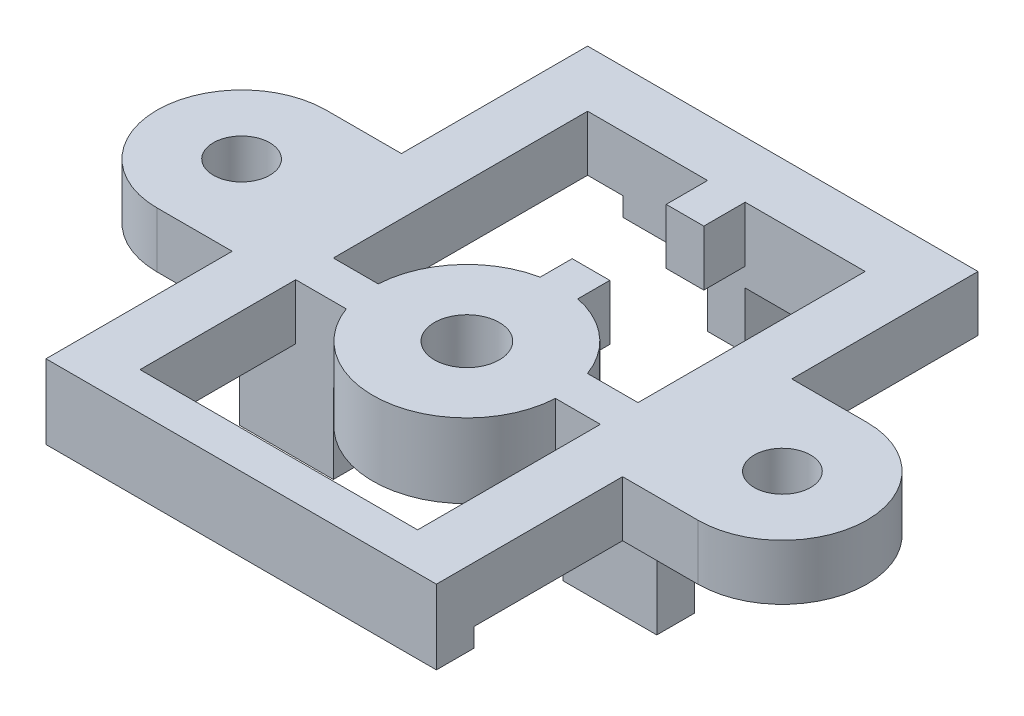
ISO-10303-21;
HEADER;
FILE_DESCRIPTION(('STEP AP214'),'2;1');
FILE_NAME('part.step','',(''),(''),'','','');
FILE_SCHEMA(('AUTOMOTIVE_DESIGN { 1 0 10303 214 1 1 1 1 }'));
ENDSEC;
DATA;
#1=APPLICATION_CONTEXT('core data for automotive mechanical design processes');
#2=APPLICATION_PROTOCOL_DEFINITION('international standard','automotive_design',2000,#1);
#3=PRODUCT_CONTEXT('',#1,'mechanical');
#4=PRODUCT('Part','Part','',(#3));
#5=PRODUCT_RELATED_PRODUCT_CATEGORY('part','',(#4));
#6=PRODUCT_DEFINITION_FORMATION('','',#4);
#7=PRODUCT_DEFINITION_CONTEXT('part definition',#1,'design');
#8=PRODUCT_DEFINITION('design','',#6,#7);
#9=PRODUCT_DEFINITION_SHAPE('','',#8);
#10=(LENGTH_UNIT() NAMED_UNIT(*) SI_UNIT(.MILLI.,.METRE.));
#11=(NAMED_UNIT(*) PLANE_ANGLE_UNIT() SI_UNIT($,.RADIAN.));
#12=(NAMED_UNIT(*) SI_UNIT($,.STERADIAN.) SOLID_ANGLE_UNIT());
#13=UNCERTAINTY_MEASURE_WITH_UNIT(LENGTH_MEASURE(1.E-05),#10,'distance_accuracy_value','');
#14=(GEOMETRIC_REPRESENTATION_CONTEXT(3) GLOBAL_UNCERTAINTY_ASSIGNED_CONTEXT((#13)) GLOBAL_UNIT_ASSIGNED_CONTEXT((#10,
#11,#12)) REPRESENTATION_CONTEXT('',''));
#15=CARTESIAN_POINT('',(0.,0.,0.));
#16=DIRECTION('',(0.,0.,1.));
#17=DIRECTION('',(1.,0.,0.));
#18=AXIS2_PLACEMENT_3D('',#15,#16,#17);
#19=CARTESIAN_POINT('',(0.,-13.,0.));
#20=DIRECTION('',(0.,-1.,0.));
#21=DIRECTION('',(1.,0.,0.));
#22=AXIS2_PLACEMENT_3D('',#19,#20,#21);
#23=PLANE('',#22);
#24=CARTESIAN_POINT('',(-49.37,-13.,-43.4));
#25=DIRECTION('',(0.,1.,0.));
#26=DIRECTION('',(-1.,0.,0.));
#27=AXIS2_PLACEMENT_3D('',#24,#25,#26);
#28=CIRCLE('',#27,1.5);
#29=CARTESIAN_POINT('',(-50.87,-13.,-43.4));
#30=VERTEX_POINT('',#29);
#31=EDGE_CURVE('E508',#30,#30,#28,.F.);
#32=ORIENTED_EDGE('',*,*,#31,.T.);
#33=EDGE_LOOP('',(#32));
#34=FACE_BOUND('',#33,.T.);
#35=CARTESIAN_POINT('',(-78.13,-13.,-43.4));
#36=DIRECTION('',(0.,1.,0.));
#37=DIRECTION('',(-1.,0.,0.));
#38=AXIS2_PLACEMENT_3D('',#35,#36,#37);
#39=CIRCLE('',#38,1.5);
#40=CARTESIAN_POINT('',(-79.63,-13.,-43.4));
#41=VERTEX_POINT('',#40);
#42=EDGE_CURVE('E529',#41,#41,#39,.T.);
#43=ORIENTED_EDGE('',*,*,#42,.F.);
#44=EDGE_LOOP('',(#43));
#45=FACE_BOUND('',#44,.T.);
#46=CARTESIAN_POINT('',(-63.75,-13.,-41.));
#47=DIRECTION('',(0.,-1.,0.));
#48=DIRECTION('',(1.,0.,0.));
#49=AXIS2_PLACEMENT_3D('',#46,#47,#48);
#50=CIRCLE('',#49,1.725);
#51=CARTESIAN_POINT('',(-62.025,-13.,-41.));
#52=VERTEX_POINT('',#51);
#53=EDGE_CURVE('E610',#52,#52,#50,.F.);
#54=ORIENTED_EDGE('',*,*,#53,.F.);
#55=EDGE_LOOP('',(#54));
#56=FACE_BOUND('',#55,.T.);
#57=DIRECTION('',(0.,0.,1.));
#58=VECTOR('',#57,1.);
#59=CARTESIAN_POINT('',(-53.37,-13.,0.));
#60=LINE('',#59,#58);
#61=CARTESIAN_POINT('',(-53.37,-13.,-57.8));
#62=VERTEX_POINT('',#61);
#63=CARTESIAN_POINT('',(-53.37,-13.,-47.9));
#64=VERTEX_POINT('',#63);
#65=EDGE_CURVE('E566',#62,#64,#60,.T.);
#66=ORIENTED_EDGE('',*,*,#65,.F.);
#67=DIRECTION('',(1.,0.,0.));
#68=VECTOR('',#67,1.);
#69=CARTESIAN_POINT('',(0.,-13.,-57.8));
#70=LINE('',#69,#68);
#71=CARTESIAN_POINT('',(-74.13,-13.,-57.8));
#72=VERTEX_POINT('',#71);
#73=EDGE_CURVE('E562',#72,#62,#70,.T.);
#74=ORIENTED_EDGE('',*,*,#73,.F.);
#75=DIRECTION('',(0.,0.,-1.));
#76=VECTOR('',#75,1.);
#77=CARTESIAN_POINT('',(-74.13,-13.,0.));
#78=LINE('',#77,#76);
#79=CARTESIAN_POINT('',(-74.13,-13.,-47.9));
#80=VERTEX_POINT('',#79);
#81=EDGE_CURVE('E559',#80,#72,#78,.T.);
#82=ORIENTED_EDGE('',*,*,#81,.F.);
#83=DIRECTION('',(1.,0.,0.));
#84=VECTOR('',#83,1.);
#85=CARTESIAN_POINT('',(0.,-13.,-47.9));
#86=LINE('',#85,#84);
#87=CARTESIAN_POINT('',(-78.13,-13.,-47.9));
#88=VERTEX_POINT('',#87);
#89=EDGE_CURVE('E537',#88,#80,#86,.T.);
#90=ORIENTED_EDGE('',*,*,#89,.F.);
#91=CARTESIAN_POINT('',(-78.13,-13.,-43.4));
#92=DIRECTION('',(0.,1.,0.));
#93=DIRECTION('',(-1.,0.,0.));
#94=AXIS2_PLACEMENT_3D('',#91,#92,#93);
#95=CIRCLE('',#94,4.5);
#96=CARTESIAN_POINT('',(-78.13,-13.,-38.9));
#97=VERTEX_POINT('',#96);
#98=EDGE_CURVE('E540',#88,#97,#95,.T.);
#99=ORIENTED_EDGE('',*,*,#98,.T.);
#100=DIRECTION('',(1.,0.,0.));
#101=VECTOR('',#100,1.);
#102=CARTESIAN_POINT('',(0.,-13.,-38.9));
#103=LINE('',#102,#101);
#104=CARTESIAN_POINT('',(-74.13,-13.,-38.9));
#105=VERTEX_POINT('',#104);
#106=EDGE_CURVE('E543',#97,#105,#103,.T.);
#107=ORIENTED_EDGE('',*,*,#106,.T.);
#108=CARTESIAN_POINT('',(-74.13,-13.,-29.));
#109=VERTEX_POINT('',#108);
#110=EDGE_CURVE('E560',#109,#105,#78,.T.);
#111=ORIENTED_EDGE('',*,*,#110,.F.);
#112=DIRECTION('',(-1.,0.,0.));
#113=VECTOR('',#112,1.);
#114=CARTESIAN_POINT('',(0.,-13.,-29.));
#115=LINE('',#114,#113);
#116=CARTESIAN_POINT('',(-53.37,-13.,-29.));
#117=VERTEX_POINT('',#116);
#118=EDGE_CURVE('E533',#117,#109,#115,.T.);
#119=ORIENTED_EDGE('',*,*,#118,.F.);
#120=CARTESIAN_POINT('',(-53.37,-13.,-38.9));
#121=VERTEX_POINT('',#120);
#122=EDGE_CURVE('E565',#121,#117,#60,.T.);
#123=ORIENTED_EDGE('',*,*,#122,.F.);
#124=DIRECTION('',(-1.,0.,0.));
#125=VECTOR('',#124,1.);
#126=CARTESIAN_POINT('',(0.,-13.,-38.9));
#127=LINE('',#126,#125);
#128=CARTESIAN_POINT('',(-49.37,-13.,-38.9));
#129=VERTEX_POINT('',#128);
#130=EDGE_CURVE('E505',#129,#121,#127,.T.);
#131=ORIENTED_EDGE('',*,*,#130,.F.);
#132=CARTESIAN_POINT('',(-49.37,-13.,-43.4));
#133=DIRECTION('',(0.,1.,0.));
#134=DIRECTION('',(-1.,0.,0.));
#135=AXIS2_PLACEMENT_3D('',#132,#133,#134);
#136=CIRCLE('',#135,4.5);
#137=CARTESIAN_POINT('',(-49.37,-13.,-47.9));
#138=VERTEX_POINT('',#137);
#139=EDGE_CURVE('E499',#138,#129,#136,.F.);
#140=ORIENTED_EDGE('',*,*,#139,.F.);
#141=DIRECTION('',(-1.,0.,0.));
#142=VECTOR('',#141,1.);
#143=CARTESIAN_POINT('',(0.,-13.,-47.9));
#144=LINE('',#143,#142);
#145=EDGE_CURVE('E502',#138,#64,#144,.T.);
#146=ORIENTED_EDGE('',*,*,#145,.T.);
#147=EDGE_LOOP('',(#66,#74,#82,#90,#99,#107,#111,#119,#123,#131,#140,#146));
#148=FACE_BOUND('',#147,.T.);
#149=DIRECTION('',(1.,0.,0.));
#150=VECTOR('',#149,1.);
#151=CARTESIAN_POINT('',(-127.5,-13.,-31.));
#152=LINE('',#151,#150);
#153=CARTESIAN_POINT('',(-71.13,-13.,-31.));
#154=VERTEX_POINT('',#153);
#155=CARTESIAN_POINT('',(-56.37,-13.,-31.));
#156=VERTEX_POINT('',#155);
#157=EDGE_CURVE('E592',#154,#156,#152,.T.);
#158=ORIENTED_EDGE('',*,*,#157,.F.);
#159=DIRECTION('',(0.,0.,1.));
#160=VECTOR('',#159,1.);
#161=CARTESIAN_POINT('',(-71.13,-13.,-2.00000000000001));
#162=LINE('',#161,#160);
#163=CARTESIAN_POINT('',(-71.13,-13.,-39.28));
#164=VERTEX_POINT('',#163);
#165=EDGE_CURVE('E586',#164,#154,#162,.T.);
#166=ORIENTED_EDGE('',*,*,#165,.F.);
#167=DIRECTION('',(-1.,0.,0.));
#168=VECTOR('',#167,1.);
#169=CARTESIAN_POINT('',(-127.5,-13.,-39.28));
#170=LINE('',#169,#168);
#171=CARTESIAN_POINT('',(-68.4448482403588,-13.,-39.28));
#172=VERTEX_POINT('',#171);
#173=EDGE_CURVE('E582',#172,#164,#170,.T.);
#174=ORIENTED_EDGE('',*,*,#173,.F.);
#175=CARTESIAN_POINT('',(-63.75,-13.,-41.));
#176=DIRECTION('',(0.,-1.,0.));
#177=DIRECTION('',(1.,0.,0.));
#178=AXIS2_PLACEMENT_3D('',#175,#176,#177);
#179=CIRCLE('',#178,5.00000000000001);
#180=CARTESIAN_POINT('',(-58.7578461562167,-13.,-40.72));
#181=VERTEX_POINT('',#180);
#182=EDGE_CURVE('E589',#181,#172,#179,.T.);
#183=ORIENTED_EDGE('',*,*,#182,.F.);
#184=DIRECTION('',(1.,0.,0.));
#185=VECTOR('',#184,1.);
#186=CARTESIAN_POINT('',(-127.5,-13.,-40.72));
#187=LINE('',#186,#185);
#188=CARTESIAN_POINT('',(-56.37,-13.,-40.72));
#189=VERTEX_POINT('',#188);
#190=EDGE_CURVE('E595',#181,#189,#187,.T.);
#191=ORIENTED_EDGE('',*,*,#190,.T.);
#192=DIRECTION('',(0.,0.,-1.));
#193=VECTOR('',#192,1.);
#194=CARTESIAN_POINT('',(-56.37,-13.,-2.00000000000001));
#195=LINE('',#194,#193);
#196=EDGE_CURVE('E597',#156,#189,#195,.T.);
#197=ORIENTED_EDGE('',*,*,#196,.F.);
#198=EDGE_LOOP('',(#158,#166,#174,#183,#191,#197));
#199=FACE_BOUND('',#198,.T.);
#200=DIRECTION('',(1.,0.,0.));
#201=VECTOR('',#200,1.);
#202=CARTESIAN_POINT('',(0.,-13.,-47.6));
#203=LINE('',#202,#201);
#204=CARTESIAN_POINT('',(-64.75,-13.,-47.6));
#205=VERTEX_POINT('',#204);
#206=CARTESIAN_POINT('',(-62.75,-13.,-47.6));
#207=VERTEX_POINT('',#206);
#208=EDGE_CURVE('E12',#205,#207,#203,.T.);
#209=ORIENTED_EDGE('',*,*,#208,.F.);
#210=DIRECTION('',(0.,0.,-1.));
#211=VECTOR('',#210,1.);
#212=CARTESIAN_POINT('',(-64.75,-13.,-2.00000000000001));
#213=LINE('',#212,#211);
#214=CARTESIAN_POINT('',(-64.75,-13.,-45.8989794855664));
#215=VERTEX_POINT('',#214);
#216=EDGE_CURVE('E373',#215,#205,#213,.T.);
#217=ORIENTED_EDGE('',*,*,#216,.F.);
#218=CARTESIAN_POINT('',(-63.75,-13.,-41.));
#219=DIRECTION('',(0.,-1.,0.));
#220=DIRECTION('',(1.,0.,0.));
#221=AXIS2_PLACEMENT_3D('',#218,#219,#220);
#222=CIRCLE('',#221,5.00000000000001);
#223=CARTESIAN_POINT('',(-68.7421538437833,-13.,-41.28));
#224=VERTEX_POINT('',#223);
#225=EDGE_CURVE('E573',#224,#215,#222,.T.);
#226=ORIENTED_EDGE('',*,*,#225,.F.);
#227=DIRECTION('',(-1.,0.,0.));
#228=VECTOR('',#227,1.);
#229=CARTESIAN_POINT('',(-127.5,-13.,-41.28));
#230=LINE('',#229,#228);
#231=CARTESIAN_POINT('',(-71.13,-13.,-41.28));
#232=VERTEX_POINT('',#231);
#233=EDGE_CURVE('E568',#224,#232,#230,.T.);
#234=ORIENTED_EDGE('',*,*,#233,.T.);
#235=DIRECTION('',(0.,0.,1.));
#236=VECTOR('',#235,1.);
#237=CARTESIAN_POINT('',(-71.13,-13.,-2.00000000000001));
#238=LINE('',#237,#236);
#239=CARTESIAN_POINT('',(-71.13,-13.,-54.8));
#240=VERTEX_POINT('',#239);
#241=EDGE_CURVE('E570',#240,#232,#238,.T.);
#242=ORIENTED_EDGE('',*,*,#241,.F.);
#243=DIRECTION('',(1.,0.,0.));
#244=VECTOR('',#243,1.);
#245=CARTESIAN_POINT('',(-127.5,-13.,-54.8));
#246=LINE('',#245,#244);
#247=CARTESIAN_POINT('',(-64.75,-13.,-54.8));
#248=VERTEX_POINT('',#247);
#249=EDGE_CURVE('E579',#240,#248,#246,.T.);
#250=ORIENTED_EDGE('',*,*,#249,.T.);
#251=CARTESIAN_POINT('',(-64.75,-13.,-52.6));
#252=VERTEX_POINT('',#251);
#253=EDGE_CURVE('E576',#252,#248,#213,.T.);
#254=ORIENTED_EDGE('',*,*,#253,.F.);
#255=DIRECTION('',(-1.,0.,0.));
#256=VECTOR('',#255,1.);
#257=CARTESIAN_POINT('',(0.,-13.,-52.6));
#258=LINE('',#257,#256);
#259=CARTESIAN_POINT('',(-62.75,-13.,-52.6));
#260=VERTEX_POINT('',#259);
#261=EDGE_CURVE('E51',#260,#252,#258,.T.);
#262=ORIENTED_EDGE('',*,*,#261,.F.);
#263=DIRECTION('',(0.,0.,-1.));
#264=VECTOR('',#263,1.);
#265=CARTESIAN_POINT('',(-62.75,-13.,-2.00000000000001));
#266=LINE('',#265,#264);
#267=CARTESIAN_POINT('',(-62.75,-13.,-54.8));
#268=VERTEX_POINT('',#267);
#269=EDGE_CURVE('E609',#260,#268,#266,.T.);
#270=ORIENTED_EDGE('',*,*,#269,.T.);
#271=CARTESIAN_POINT('',(-56.37,-13.,-54.8));
#272=VERTEX_POINT('',#271);
#273=EDGE_CURVE('E583',#268,#272,#246,.T.);
#274=ORIENTED_EDGE('',*,*,#273,.T.);
#275=DIRECTION('',(0.,0.,-1.));
#276=VECTOR('',#275,1.);
#277=CARTESIAN_POINT('',(-56.37,-13.,-2.00000000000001));
#278=LINE('',#277,#276);
#279=CARTESIAN_POINT('',(-56.37,-13.,-42.72));
#280=VERTEX_POINT('',#279);
#281=EDGE_CURVE('E603',#280,#272,#278,.T.);
#282=ORIENTED_EDGE('',*,*,#281,.F.);
#283=DIRECTION('',(1.,0.,0.));
#284=VECTOR('',#283,1.);
#285=CARTESIAN_POINT('',(-127.5,-13.,-42.72));
#286=LINE('',#285,#284);
#287=CARTESIAN_POINT('',(-59.0551517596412,-13.,-42.72));
#288=VERTEX_POINT('',#287);
#289=EDGE_CURVE('E600',#288,#280,#286,.T.);
#290=ORIENTED_EDGE('',*,*,#289,.F.);
#291=CARTESIAN_POINT('',(-62.75,-13.,-45.8989794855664));
#292=VERTEX_POINT('',#291);
#293=EDGE_CURVE('E577',#292,#288,#222,.T.);
#294=ORIENTED_EDGE('',*,*,#293,.F.);
#295=EDGE_CURVE('E606',#292,#207,#266,.T.);
#296=ORIENTED_EDGE('',*,*,#295,.T.);
#297=EDGE_LOOP('',(#209,#217,#226,#234,#242,#250,#254,#262,#270,#274,#282,#290,#294,#296));
#298=FACE_BOUND('',#297,.T.);
#299=ADVANCED_FACE('F43',(#34,#45,#56,#148,#199,#298),#23,.F.);
#300=CARTESIAN_POINT('',(-64.75,-50.8501120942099,-2.00000000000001));
#301=DIRECTION('',(1.,0.,0.));
#302=DIRECTION('',(0.,0.,-1.));
#303=AXIS2_PLACEMENT_3D('',#300,#301,#302);
#304=PLANE('',#303);
#305=DIRECTION('',(0.,-1.,0.));
#306=VECTOR('',#305,1.);
#307=CARTESIAN_POINT('',(-64.75,29.,-47.6));
#308=LINE('',#307,#306);
#309=CARTESIAN_POINT('',(-64.75,-15.95,-47.6));
#310=VERTEX_POINT('',#309);
#311=EDGE_CURVE('E65',#205,#310,#308,.T.);
#312=ORIENTED_EDGE('',*,*,#311,.T.);
#313=DIRECTION('',(0.,0.,-1.));
#314=VECTOR('',#313,1.);
#315=CARTESIAN_POINT('',(-64.75,-15.95,-2.00000000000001));
#316=LINE('',#315,#314);
#317=CARTESIAN_POINT('',(-64.75,-15.95,-45.8989794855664));
#318=VERTEX_POINT('',#317);
#319=EDGE_CURVE('E371',#318,#310,#316,.T.);
#320=ORIENTED_EDGE('',*,*,#319,.F.);
#321=DIRECTION('',(0.,1.,0.));
#322=VECTOR('',#321,1.);
#323=CARTESIAN_POINT('',(-64.75,-50.8501120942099,-45.8989794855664));
#324=LINE('',#323,#322);
#325=EDGE_CURVE('E410',#318,#215,#324,.T.);
#326=ORIENTED_EDGE('',*,*,#325,.T.);
#327=ORIENTED_EDGE('',*,*,#216,.T.);
#328=EDGE_LOOP('',(#312,#320,#326,#327));
#329=FACE_BOUND('',#328,.T.);
#330=ADVANCED_FACE('F369',(#329),#304,.F.);
#331=CARTESIAN_POINT('',(-127.5,-15.95,-2.00000000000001));
#332=DIRECTION('',(0.,-1.,0.));
#333=DIRECTION('',(0.,0.,-1.));
#334=AXIS2_PLACEMENT_3D('',#331,#332,#333);
#335=PLANE('',#334);
#336=ORIENTED_EDGE('',*,*,#319,.T.);
#337=DIRECTION('',(1.,0.,0.));
#338=VECTOR('',#337,1.);
#339=CARTESIAN_POINT('',(0.,-15.95,-47.6));
#340=LINE('',#339,#338);
#341=CARTESIAN_POINT('',(-62.75,-15.95,-47.6));
#342=VERTEX_POINT('',#341);
#343=EDGE_CURVE('E357',#310,#342,#340,.T.);
#344=ORIENTED_EDGE('',*,*,#343,.T.);
#345=DIRECTION('',(0.,0.,-1.));
#346=VECTOR('',#345,1.);
#347=CARTESIAN_POINT('',(-62.75,-15.95,-2.00000000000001));
#348=LINE('',#347,#346);
#349=CARTESIAN_POINT('',(-62.75,-15.95,-45.8989794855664));
#350=VERTEX_POINT('',#349);
#351=EDGE_CURVE('E405',#350,#342,#348,.T.);
#352=ORIENTED_EDGE('',*,*,#351,.F.);
#353=CARTESIAN_POINT('',(-63.75,-15.95,-41.));
#354=DIRECTION('',(0.,-1.,0.));
#355=DIRECTION('',(0.,0.,-1.));
#356=AXIS2_PLACEMENT_3D('',#353,#354,#355);
#357=CIRCLE('',#356,5.00000000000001);
#358=EDGE_CURVE('E378',#318,#350,#357,.T.);
#359=ORIENTED_EDGE('',*,*,#358,.F.);
#360=EDGE_LOOP('',(#336,#344,#352,#359));
#361=FACE_BOUND('',#360,.T.);
#362=ADVANCED_FACE('F376',(#361),#335,.T.);
#363=CARTESIAN_POINT('',(-62.75,-50.8501120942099,-2.00000000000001));
#364=DIRECTION('',(1.,0.,0.));
#365=DIRECTION('',(0.,0.,-1.));
#366=AXIS2_PLACEMENT_3D('',#363,#364,#365);
#367=PLANE('',#366);
#368=ORIENTED_EDGE('',*,*,#351,.T.);
#369=DIRECTION('',(0.,-1.,0.));
#370=VECTOR('',#369,1.);
#371=CARTESIAN_POINT('',(-62.75,29.,-47.6));
#372=LINE('',#371,#370);
#373=EDGE_CURVE('E360',#207,#342,#372,.T.);
#374=ORIENTED_EDGE('',*,*,#373,.F.);
#375=ORIENTED_EDGE('',*,*,#295,.F.);
#376=DIRECTION('',(0.,1.,0.));
#377=VECTOR('',#376,1.);
#378=CARTESIAN_POINT('',(-62.75,-50.8501120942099,-45.8989794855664));
#379=LINE('',#378,#377);
#380=EDGE_CURVE('E406',#350,#292,#379,.T.);
#381=ORIENTED_EDGE('',*,*,#380,.F.);
#382=EDGE_LOOP('',(#368,#374,#375,#381));
#383=FACE_BOUND('',#382,.T.);
#384=ADVANCED_FACE('F917',(#383),#367,.T.);
#385=CARTESIAN_POINT('',(0.,29.,-47.6));
#386=DIRECTION('',(0.,0.,-1.));
#387=DIRECTION('',(-1.,0.,0.));
#388=AXIS2_PLACEMENT_3D('',#385,#386,#387);
#389=PLANE('',#388);
#390=ORIENTED_EDGE('',*,*,#208,.T.);
#391=ORIENTED_EDGE('',*,*,#373,.T.);
#392=ORIENTED_EDGE('',*,*,#343,.F.);
#393=ORIENTED_EDGE('',*,*,#311,.F.);
#394=EDGE_LOOP('',(#390,#391,#392,#393));
#395=FACE_BOUND('',#394,.T.);
#396=ADVANCED_FACE('F358',(#395),#389,.T.);
#397=ORIENTED_EDGE('',*,*,#269,.F.);
#398=DIRECTION('',(0.,-1.,0.));
#399=VECTOR('',#398,1.);
#400=CARTESIAN_POINT('',(-62.75,29.,-52.6));
#401=LINE('',#400,#399);
#402=CARTESIAN_POINT('',(-62.75,-15.95,-52.6));
#403=VERTEX_POINT('',#402);
#404=EDGE_CURVE('E58',#260,#403,#401,.T.);
#405=ORIENTED_EDGE('',*,*,#404,.T.);
#406=CARTESIAN_POINT('',(-62.75,-15.95,-54.8));
#407=VERTEX_POINT('',#406);
#408=EDGE_CURVE('E409',#403,#407,#348,.T.);
#409=ORIENTED_EDGE('',*,*,#408,.T.);
#410=DIRECTION('',(0.,1.,0.));
#411=VECTOR('',#410,1.);
#412=CARTESIAN_POINT('',(-62.75,-50.8501120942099,-54.8));
#413=LINE('',#412,#411);
#414=EDGE_CURVE('E402',#407,#268,#413,.T.);
#415=ORIENTED_EDGE('',*,*,#414,.T.);
#416=EDGE_LOOP('',(#397,#405,#409,#415));
#417=FACE_BOUND('',#416,.T.);
#418=ADVANCED_FACE('F764',(#417),#367,.T.);
#419=ORIENTED_EDGE('',*,*,#408,.F.);
#420=DIRECTION('',(-1.,0.,0.));
#421=VECTOR('',#420,1.);
#422=CARTESIAN_POINT('',(0.,-15.95,-52.6));
#423=LINE('',#422,#421);
#424=CARTESIAN_POINT('',(-64.75,-15.95,-52.6));
#425=VERTEX_POINT('',#424);
#426=EDGE_CURVE('E364',#403,#425,#423,.T.);
#427=ORIENTED_EDGE('',*,*,#426,.T.);
#428=CARTESIAN_POINT('',(-64.75,-15.95,-54.8));
#429=VERTEX_POINT('',#428);
#430=EDGE_CURVE('E380',#425,#429,#316,.T.);
#431=ORIENTED_EDGE('',*,*,#430,.T.);
#432=DIRECTION('',(1.,0.,0.));
#433=VECTOR('',#432,1.);
#434=CARTESIAN_POINT('',(-127.5,-15.95,-54.8));
#435=LINE('',#434,#433);
#436=EDGE_CURVE('E716',#429,#407,#435,.T.);
#437=ORIENTED_EDGE('',*,*,#436,.T.);
#438=EDGE_LOOP('',(#419,#427,#431,#437));
#439=FACE_BOUND('',#438,.T.);
#440=ADVANCED_FACE('F769',(#439),#335,.T.);
#441=DIRECTION('',(0.,-1.,0.));
#442=VECTOR('',#441,1.);
#443=CARTESIAN_POINT('',(-64.75,29.,-52.6));
#444=LINE('',#443,#442);
#445=EDGE_CURVE('E374',#252,#425,#444,.T.);
#446=ORIENTED_EDGE('',*,*,#445,.F.);
#447=ORIENTED_EDGE('',*,*,#253,.T.);
#448=DIRECTION('',(0.,1.,0.));
#449=VECTOR('',#448,1.);
#450=CARTESIAN_POINT('',(-64.75,-50.8501120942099,-54.8));
#451=LINE('',#450,#449);
#452=EDGE_CURVE('E390',#429,#248,#451,.T.);
#453=ORIENTED_EDGE('',*,*,#452,.F.);
#454=ORIENTED_EDGE('',*,*,#430,.F.);
#455=EDGE_LOOP('',(#446,#447,#453,#454));
#456=FACE_BOUND('',#455,.T.);
#457=ADVANCED_FACE('F925',(#456),#304,.F.);
#458=CARTESIAN_POINT('',(0.,29.,-52.6));
#459=DIRECTION('',(0.,0.,1.));
#460=DIRECTION('',(1.,0.,0.));
#461=AXIS2_PLACEMENT_3D('',#458,#459,#460);
#462=PLANE('',#461);
#463=ORIENTED_EDGE('',*,*,#261,.T.);
#464=ORIENTED_EDGE('',*,*,#445,.T.);
#465=ORIENTED_EDGE('',*,*,#426,.F.);
#466=ORIENTED_EDGE('',*,*,#404,.F.);
#467=EDGE_LOOP('',(#463,#464,#465,#466));
#468=FACE_BOUND('',#467,.T.);
#469=ADVANCED_FACE('F922',(#468),#462,.T.);
#470=CARTESIAN_POINT('',(-56.37,-50.8501120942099,-2.00000000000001));
#471=DIRECTION('',(1.,0.,0.));
#472=DIRECTION('',(0.,0.,-1.));
#473=AXIS2_PLACEMENT_3D('',#470,#471,#472);
#474=PLANE('',#473);
#475=DIRECTION('',(0.,-1.,0.));
#476=VECTOR('',#475,1.);
#477=CARTESIAN_POINT('',(-56.37,-50.8501120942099,-42.72));
#478=LINE('',#477,#476);
#479=CARTESIAN_POINT('',(-56.37,-15.95,-42.72));
#480=VERTEX_POINT('',#479);
#481=EDGE_CURVE('E476',#280,#480,#478,.T.);
#482=ORIENTED_EDGE('',*,*,#481,.F.);
#483=ORIENTED_EDGE('',*,*,#281,.T.);
#484=DIRECTION('',(0.,1.,0.));
#485=VECTOR('',#484,1.);
#486=CARTESIAN_POINT('',(-56.37,-50.8501120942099,-54.8));
#487=LINE('',#486,#485);
#488=CARTESIAN_POINT('',(-56.37,-15.95,-54.8));
#489=VERTEX_POINT('',#488);
#490=EDGE_CURVE('E399',#489,#272,#487,.T.);
#491=ORIENTED_EDGE('',*,*,#490,.F.);
#492=DIRECTION('',(0.,0.,-1.));
#493=VECTOR('',#492,1.);
#494=CARTESIAN_POINT('',(-56.37,-15.95,-2.00000000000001));
#495=LINE('',#494,#493);
#496=EDGE_CURVE('E753',#480,#489,#495,.T.);
#497=ORIENTED_EDGE('',*,*,#496,.F.);
#498=EDGE_LOOP('',(#482,#483,#491,#497));
#499=FACE_BOUND('',#498,.T.);
#500=ADVANCED_FACE('F781',(#499),#474,.F.);
#501=CARTESIAN_POINT('',(-53.37,-11.,-2.00000000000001));
#502=DIRECTION('',(-1.,0.,0.));
#503=DIRECTION('',(0.,0.,1.));
#504=AXIS2_PLACEMENT_3D('',#501,#502,#503);
#505=PLANE('',#504);
#506=DIRECTION('',(0.,0.,-1.));
#507=VECTOR('',#506,1.);
#508=CARTESIAN_POINT('',(-53.37,-15.95,0.));
#509=LINE('',#508,#507);
#510=CARTESIAN_POINT('',(-53.37,-15.95,-40.72));
#511=VERTEX_POINT('',#510);
#512=CARTESIAN_POINT('',(-53.37,-15.95,-42.72));
#513=VERTEX_POINT('',#512);
#514=EDGE_CURVE('E482',#511,#513,#509,.T.);
#515=ORIENTED_EDGE('',*,*,#514,.F.);
#516=DIRECTION('',(0.,1.,0.));
#517=VECTOR('',#516,1.);
#518=CARTESIAN_POINT('',(-53.37,-30.8351648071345,-40.72));
#519=LINE('',#518,#517);
#520=CARTESIAN_POINT('',(-53.37,-21.2,-40.72));
#521=VERTEX_POINT('',#520);
#522=EDGE_CURVE('E644',#521,#511,#519,.T.);
#523=ORIENTED_EDGE('',*,*,#522,.F.);
#524=DIRECTION('',(0.,0.,-1.));
#525=VECTOR('',#524,1.);
#526=CARTESIAN_POINT('',(-53.37,-21.2,-2.00000000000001));
#527=LINE('',#526,#525);
#528=CARTESIAN_POINT('',(-53.37,-21.2,-42.72));
#529=VERTEX_POINT('',#528);
#530=EDGE_CURVE('E646',#521,#529,#527,.T.);
#531=ORIENTED_EDGE('',*,*,#530,.T.);
#532=DIRECTION('',(0.,1.,0.));
#533=VECTOR('',#532,1.);
#534=CARTESIAN_POINT('',(-53.37,-30.8351648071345,-42.72));
#535=LINE('',#534,#533);
#536=EDGE_CURVE('E645',#529,#513,#535,.T.);
#537=ORIENTED_EDGE('',*,*,#536,.T.);
#538=EDGE_LOOP('',(#515,#523,#531,#537));
#539=FACE_BOUND('',#538,.T.);
#540=ADVANCED_FACE('F899',(#539),#505,.F.);
#541=CARTESIAN_POINT('',(-127.5,-21.2,-2.00000000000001));
#542=DIRECTION('',(0.,-1.,0.));
#543=DIRECTION('',(0.,0.,-1.));
#544=AXIS2_PLACEMENT_3D('',#541,#542,#543);
#545=PLANE('',#544);
#546=DIRECTION('',(0.,0.,-1.));
#547=VECTOR('',#546,1.);
#548=CARTESIAN_POINT('',(-58.37,-21.2,-2.00000000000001));
#549=LINE('',#548,#547);
#550=CARTESIAN_POINT('',(-58.37,-21.2,-40.72));
#551=VERTEX_POINT('',#550);
#552=CARTESIAN_POINT('',(-58.37,-21.2,-42.72));
#553=VERTEX_POINT('',#552);
#554=EDGE_CURVE('E652',#551,#553,#549,.T.);
#555=ORIENTED_EDGE('',*,*,#554,.T.);
#556=DIRECTION('',(1.,0.,0.));
#557=VECTOR('',#556,1.);
#558=CARTESIAN_POINT('',(-127.5,-21.2,-42.72));
#559=LINE('',#558,#557);
#560=EDGE_CURVE('E648',#553,#529,#559,.T.);
#561=ORIENTED_EDGE('',*,*,#560,.T.);
#562=ORIENTED_EDGE('',*,*,#530,.F.);
#563=DIRECTION('',(1.,0.,0.));
#564=VECTOR('',#563,1.);
#565=CARTESIAN_POINT('',(-127.5,-21.2,-40.72));
#566=LINE('',#565,#564);
#567=EDGE_CURVE('E642',#551,#521,#566,.T.);
#568=ORIENTED_EDGE('',*,*,#567,.F.);
#569=EDGE_LOOP('',(#555,#561,#562,#568));
#570=FACE_BOUND('',#569,.T.);
#571=ADVANCED_FACE('F901',(#570),#545,.T.);
#572=CARTESIAN_POINT('',(-58.37,-30.8351648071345,-2.00000000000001));
#573=DIRECTION('',(1.,0.,0.));
#574=DIRECTION('',(0.,0.,-1.));
#575=AXIS2_PLACEMENT_3D('',#572,#573,#574);
#576=PLANE('',#575);
#577=DIRECTION('',(0.,0.,-1.));
#578=VECTOR('',#577,1.);
#579=CARTESIAN_POINT('',(-58.37,-16.95,-2.00000000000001));
#580=LINE('',#579,#578);
#581=CARTESIAN_POINT('',(-58.37,-16.95,-40.72));
#582=VERTEX_POINT('',#581);
#583=CARTESIAN_POINT('',(-58.37,-16.95,-42.72));
#584=VERTEX_POINT('',#583);
#585=EDGE_CURVE('E425',#582,#584,#580,.T.);
#586=ORIENTED_EDGE('',*,*,#585,.T.);
#587=DIRECTION('',(0.,1.,0.));
#588=VECTOR('',#587,1.);
#589=CARTESIAN_POINT('',(-58.37,-30.8351648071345,-42.72));
#590=LINE('',#589,#588);
#591=EDGE_CURVE('E641',#553,#584,#590,.T.);
#592=ORIENTED_EDGE('',*,*,#591,.F.);
#593=ORIENTED_EDGE('',*,*,#554,.F.);
#594=DIRECTION('',(0.,1.,0.));
#595=VECTOR('',#594,1.);
#596=CARTESIAN_POINT('',(-58.37,-30.8351648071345,-40.72));
#597=LINE('',#596,#595);
#598=EDGE_CURVE('E655',#551,#582,#597,.T.);
#599=ORIENTED_EDGE('',*,*,#598,.T.);
#600=EDGE_LOOP('',(#586,#592,#593,#599));
#601=FACE_BOUND('',#600,.T.);
#602=ADVANCED_FACE('F1007',(#601),#576,.F.);
#603=DIRECTION('',(0.,1.,0.));
#604=VECTOR('',#603,1.);
#605=CARTESIAN_POINT('',(-56.37,-50.8501120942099,-31.));
#606=LINE('',#605,#604);
#607=CARTESIAN_POINT('',(-56.37,-15.95,-31.));
#608=VERTEX_POINT('',#607);
#609=EDGE_CURVE('E395',#608,#156,#606,.T.);
#610=ORIENTED_EDGE('',*,*,#609,.T.);
#611=ORIENTED_EDGE('',*,*,#196,.T.);
#612=DIRECTION('',(0.,-1.,0.));
#613=VECTOR('',#612,1.);
#614=CARTESIAN_POINT('',(-56.37,-50.8501120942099,-40.72));
#615=LINE('',#614,#613);
#616=CARTESIAN_POINT('',(-56.37,-15.95,-40.72));
#617=VERTEX_POINT('',#616);
#618=EDGE_CURVE('E474',#189,#617,#615,.T.);
#619=ORIENTED_EDGE('',*,*,#618,.T.);
#620=EDGE_CURVE('E756',#608,#617,#495,.T.);
#621=ORIENTED_EDGE('',*,*,#620,.F.);
#622=EDGE_LOOP('',(#610,#611,#619,#621));
#623=FACE_BOUND('',#622,.T.);
#624=ADVANCED_FACE('F890',(#623),#474,.F.);
#625=CARTESIAN_POINT('',(-71.13,-50.8501120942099,-2.00000000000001));
#626=DIRECTION('',(-1.,0.,0.));
#627=DIRECTION('',(0.,0.,1.));
#628=AXIS2_PLACEMENT_3D('',#625,#626,#627);
#629=PLANE('',#628);
#630=DIRECTION('',(0.,1.,0.));
#631=VECTOR('',#630,1.);
#632=CARTESIAN_POINT('',(-71.13,-50.8501120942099,-54.8));
#633=LINE('',#632,#631);
#634=CARTESIAN_POINT('',(-71.13,-15.95,-54.8));
#635=VERTEX_POINT('',#634);
#636=EDGE_CURVE('E391',#635,#240,#633,.T.);
#637=ORIENTED_EDGE('',*,*,#636,.T.);
#638=ORIENTED_EDGE('',*,*,#241,.T.);
#639=DIRECTION('',(0.,-1.,0.));
#640=VECTOR('',#639,1.);
#641=CARTESIAN_POINT('',(-71.13,-50.8501120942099,-41.28));
#642=LINE('',#641,#640);
#643=CARTESIAN_POINT('',(-71.13,-15.95,-41.28));
#644=VERTEX_POINT('',#643);
#645=EDGE_CURVE('E478',#232,#644,#642,.T.);
#646=ORIENTED_EDGE('',*,*,#645,.T.);
#647=DIRECTION('',(0.,0.,1.));
#648=VECTOR('',#647,1.);
#649=CARTESIAN_POINT('',(-71.13,-15.95,-2.00000000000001));
#650=LINE('',#649,#648);
#651=EDGE_CURVE('E382',#635,#644,#650,.T.);
#652=ORIENTED_EDGE('',*,*,#651,.F.);
#653=EDGE_LOOP('',(#637,#638,#646,#652));
#654=FACE_BOUND('',#653,.T.);
#655=ADVANCED_FACE('F873',(#654),#629,.F.);
#656=CARTESIAN_POINT('',(-127.5,-7.,-29.));
#657=DIRECTION('',(0.,0.,-1.));
#658=DIRECTION('',(-1.,0.,0.));
#659=AXIS2_PLACEMENT_3D('',#656,#657,#658);
#660=PLANE('',#659);
#661=DIRECTION('',(0.,1.,0.));
#662=VECTOR('',#661,1.);
#663=CARTESIAN_POINT('',(-53.37,-11.,-29.));
#664=LINE('',#663,#662);
#665=CARTESIAN_POINT('',(-53.37,-16.95,-29.));
#666=VERTEX_POINT('',#665);
#667=EDGE_CURVE('E465',#666,#117,#664,.T.);
#668=ORIENTED_EDGE('',*,*,#667,.T.);
#669=ORIENTED_EDGE('',*,*,#118,.T.);
#670=DIRECTION('',(0.,1.,0.));
#671=VECTOR('',#670,1.);
#672=CARTESIAN_POINT('',(-74.13,-11.,-29.));
#673=LINE('',#672,#671);
#674=CARTESIAN_POINT('',(-74.13,-16.95,-29.));
#675=VERTEX_POINT('',#674);
#676=EDGE_CURVE('E462',#675,#109,#673,.T.);
#677=ORIENTED_EDGE('',*,*,#676,.F.);
#678=DIRECTION('',(-1.,0.,0.));
#679=VECTOR('',#678,1.);
#680=CARTESIAN_POINT('',(-127.5,-16.95,-29.));
#681=LINE('',#680,#679);
#682=EDGE_CURVE('E730',#666,#675,#681,.T.);
#683=ORIENTED_EDGE('',*,*,#682,.F.);
#684=EDGE_LOOP('',(#668,#669,#677,#683));
#685=FACE_BOUND('',#684,.T.);
#686=ADVANCED_FACE('F45',(#685),#660,.F.);
#687=CARTESIAN_POINT('',(-127.5,-16.95,-2.00000000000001));
#688=DIRECTION('',(0.,-1.,0.));
#689=DIRECTION('',(0.,0.,-1.));
#690=AXIS2_PLACEMENT_3D('',#687,#688,#689);
#691=PLANE('',#690);
#692=DIRECTION('',(0.,0.,1.));
#693=VECTOR('',#692,1.);
#694=CARTESIAN_POINT('',(-53.37,-16.95,-2.00000000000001));
#695=LINE('',#694,#693);
#696=CARTESIAN_POINT('',(-53.37,-16.95,-31.));
#697=VERTEX_POINT('',#696);
#698=EDGE_CURVE('E733',#697,#666,#695,.T.);
#699=ORIENTED_EDGE('',*,*,#698,.T.);
#700=ORIENTED_EDGE('',*,*,#682,.T.);
#701=DIRECTION('',(0.,0.,-1.));
#702=VECTOR('',#701,1.);
#703=CARTESIAN_POINT('',(-74.13,-16.95,-2.00000000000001));
#704=LINE('',#703,#702);
#705=CARTESIAN_POINT('',(-74.13,-16.95,-31.));
#706=VERTEX_POINT('',#705);
#707=EDGE_CURVE('E727',#675,#706,#704,.T.);
#708=ORIENTED_EDGE('',*,*,#707,.T.);
#709=DIRECTION('',(1.,0.,0.));
#710=VECTOR('',#709,1.);
#711=CARTESIAN_POINT('',(-127.5,-16.95,-31.));
#712=LINE('',#711,#710);
#713=EDGE_CURVE('E723',#706,#697,#712,.T.);
#714=ORIENTED_EDGE('',*,*,#713,.T.);
#715=EDGE_LOOP('',(#699,#700,#708,#714));
#716=FACE_BOUND('',#715,.T.);
#717=ADVANCED_FACE('F835',(#716),#691,.T.);
#718=CARTESIAN_POINT('',(-127.5,-37.8061166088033,-31.));
#719=DIRECTION('',(0.,0.,1.));
#720=DIRECTION('',(1.,0.,0.));
#721=AXIS2_PLACEMENT_3D('',#718,#719,#720);
#722=PLANE('',#721);
#723=DIRECTION('',(0.,1.,0.));
#724=VECTOR('',#723,1.);
#725=CARTESIAN_POINT('',(-71.13,-50.8501120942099,-31.));
#726=LINE('',#725,#724);
#727=CARTESIAN_POINT('',(-71.13,-15.95,-31.));
#728=VERTEX_POINT('',#727);
#729=EDGE_CURVE('E416',#728,#154,#726,.T.);
#730=ORIENTED_EDGE('',*,*,#729,.T.);
#731=ORIENTED_EDGE('',*,*,#157,.T.);
#732=ORIENTED_EDGE('',*,*,#609,.F.);
#733=DIRECTION('',(1.,0.,0.));
#734=VECTOR('',#733,1.);
#735=CARTESIAN_POINT('',(-127.5,-15.95,-31.));
#736=LINE('',#735,#734);
#737=CARTESIAN_POINT('',(-53.37,-15.95,-31.));
#738=VERTEX_POINT('',#737);
#739=EDGE_CURVE('E398',#608,#738,#736,.T.);
#740=ORIENTED_EDGE('',*,*,#739,.T.);
#741=DIRECTION('',(0.,1.,0.));
#742=VECTOR('',#741,1.);
#743=CARTESIAN_POINT('',(-53.37,-37.8061166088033,-31.));
#744=LINE('',#743,#742);
#745=EDGE_CURVE('E736',#697,#738,#744,.T.);
#746=ORIENTED_EDGE('',*,*,#745,.F.);
#747=ORIENTED_EDGE('',*,*,#713,.F.);
#748=DIRECTION('',(0.,1.,0.));
#749=VECTOR('',#748,1.);
#750=CARTESIAN_POINT('',(-74.13,-37.8061166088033,-31.));
#751=LINE('',#750,#749);
#752=CARTESIAN_POINT('',(-74.13,-15.95,-31.));
#753=VERTEX_POINT('',#752);
#754=EDGE_CURVE('E722',#706,#753,#751,.T.);
#755=ORIENTED_EDGE('',*,*,#754,.T.);
#756=DIRECTION('',(1.,0.,0.));
#757=VECTOR('',#756,1.);
#758=CARTESIAN_POINT('',(-127.5,-15.95,-31.));
#759=LINE('',#758,#757);
#760=EDGE_CURVE('E394',#753,#728,#759,.T.);
#761=ORIENTED_EDGE('',*,*,#760,.T.);
#762=EDGE_LOOP('',(#730,#731,#732,#740,#746,#747,#755,#761));
#763=FACE_BOUND('',#762,.T.);
#764=ADVANCED_FACE('F830',(#763),#722,.F.);
#765=CARTESIAN_POINT('',(-69.25,-37.8061166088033,-2.00000000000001));
#766=DIRECTION('',(-1.,0.,0.));
#767=DIRECTION('',(0.,0.,1.));
#768=AXIS2_PLACEMENT_3D('',#765,#766,#767);
#769=PLANE('',#768);
#770=DIRECTION('',(0.,1.,0.));
#771=VECTOR('',#770,1.);
#772=CARTESIAN_POINT('',(-69.25,-37.8061166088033,-54.8));
#773=LINE('',#772,#771);
#774=CARTESIAN_POINT('',(-69.25,-16.95,-54.8));
#775=VERTEX_POINT('',#774);
#776=CARTESIAN_POINT('',(-69.25,-15.95,-54.8));
#777=VERTEX_POINT('',#776);
#778=EDGE_CURVE('E693',#775,#777,#773,.T.);
#779=ORIENTED_EDGE('',*,*,#778,.T.);
#780=DIRECTION('',(0.,0.,-1.));
#781=VECTOR('',#780,1.);
#782=CARTESIAN_POINT('',(-69.25,-15.95,-2.00000000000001));
#783=LINE('',#782,#781);
#784=CARTESIAN_POINT('',(-69.25,-15.95,-57.8));
#785=VERTEX_POINT('',#784);
#786=EDGE_CURVE('E719',#777,#785,#783,.T.);
#787=ORIENTED_EDGE('',*,*,#786,.T.);
#788=DIRECTION('',(0.,1.,0.));
#789=VECTOR('',#788,1.);
#790=CARTESIAN_POINT('',(-69.25,-37.8061166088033,-57.8));
#791=LINE('',#790,#789);
#792=CARTESIAN_POINT('',(-69.25,-16.95,-57.8));
#793=VERTEX_POINT('',#792);
#794=EDGE_CURVE('E709',#793,#785,#791,.T.);
#795=ORIENTED_EDGE('',*,*,#794,.F.);
#796=DIRECTION('',(0.,0.,1.));
#797=VECTOR('',#796,1.);
#798=CARTESIAN_POINT('',(-69.25,-16.95,-2.00000000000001));
#799=LINE('',#798,#797);
#800=EDGE_CURVE('E690',#793,#775,#799,.T.);
#801=ORIENTED_EDGE('',*,*,#800,.T.);
#802=EDGE_LOOP('',(#779,#787,#795,#801));
#803=FACE_BOUND('',#802,.T.);
#804=ADVANCED_FACE('F866',(#803),#769,.T.);
#805=CARTESIAN_POINT('',(-127.5,-16.95,-2.00000000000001));
#806=DIRECTION('',(0.,-1.,0.));
#807=DIRECTION('',(0.,0.,-1.));
#808=AXIS2_PLACEMENT_3D('',#805,#806,#807);
#809=PLANE('',#808);
#810=DIRECTION('',(1.,0.,0.));
#811=VECTOR('',#810,1.);
#812=CARTESIAN_POINT('',(-127.5,-16.95,-57.8));
#813=LINE('',#812,#811);
#814=CARTESIAN_POINT('',(-64.75,-16.95,-57.8));
#815=VERTEX_POINT('',#814);
#816=EDGE_CURVE('E702',#793,#815,#813,.T.);
#817=ORIENTED_EDGE('',*,*,#816,.T.);
#818=DIRECTION('',(0.,0.,1.));
#819=VECTOR('',#818,1.);
#820=CARTESIAN_POINT('',(-64.75,-16.95,-2.00000000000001));
#821=LINE('',#820,#819);
#822=CARTESIAN_POINT('',(-64.75,-16.95,-54.8));
#823=VERTEX_POINT('',#822);
#824=EDGE_CURVE('E468',#815,#823,#821,.T.);
#825=ORIENTED_EDGE('',*,*,#824,.T.);
#826=DIRECTION('',(-1.,0.,0.));
#827=VECTOR('',#826,1.);
#828=CARTESIAN_POINT('',(-127.5,-16.95,-54.8));
#829=LINE('',#828,#827);
#830=EDGE_CURVE('E698',#823,#775,#829,.T.);
#831=ORIENTED_EDGE('',*,*,#830,.T.);
#832=ORIENTED_EDGE('',*,*,#800,.F.);
#833=EDGE_LOOP('',(#817,#825,#831,#832));
#834=FACE_BOUND('',#833,.T.);
#835=ADVANCED_FACE('F1016',(#834),#809,.T.);
#836=CARTESIAN_POINT('',(-64.75,-26.555551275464,-2.00000000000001));
#837=DIRECTION('',(1.,0.,0.));
#838=DIRECTION('',(0.,0.,-1.));
#839=AXIS2_PLACEMENT_3D('',#836,#837,#838);
#840=PLANE('',#839);
#841=ORIENTED_EDGE('',*,*,#824,.F.);
#842=DIRECTION('',(0.,1.,0.));
#843=VECTOR('',#842,1.);
#844=CARTESIAN_POINT('',(-64.75,-26.555551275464,-57.8));
#845=LINE('',#844,#843);
#846=CARTESIAN_POINT('',(-64.75,-19.95,-57.8));
#847=VERTEX_POINT('',#846);
#848=EDGE_CURVE('E682',#847,#815,#845,.T.);
#849=ORIENTED_EDGE('',*,*,#848,.F.);
#850=DIRECTION('',(0.,0.,-1.));
#851=VECTOR('',#850,1.);
#852=CARTESIAN_POINT('',(-64.75,-19.95,-2.00000000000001));
#853=LINE('',#852,#851);
#854=CARTESIAN_POINT('',(-64.75,-19.95,-54.8));
#855=VERTEX_POINT('',#854);
#856=EDGE_CURVE('E667',#855,#847,#853,.T.);
#857=ORIENTED_EDGE('',*,*,#856,.F.);
#858=DIRECTION('',(0.,1.,0.));
#859=VECTOR('',#858,1.);
#860=CARTESIAN_POINT('',(-64.75,-26.555551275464,-54.8));
#861=LINE('',#860,#859);
#862=EDGE_CURVE('E677',#855,#823,#861,.T.);
#863=ORIENTED_EDGE('',*,*,#862,.T.);
#864=EDGE_LOOP('',(#841,#849,#857,#863));
#865=FACE_BOUND('',#864,.T.);
#866=ADVANCED_FACE('F1012',(#865),#840,.F.);
#867=CARTESIAN_POINT('',(-127.5,-19.95,-2.00000000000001));
#868=DIRECTION('',(0.,-1.,0.));
#869=DIRECTION('',(0.,0.,-1.));
#870=AXIS2_PLACEMENT_3D('',#867,#868,#869);
#871=PLANE('',#870);
#872=DIRECTION('',(1.,0.,0.));
#873=VECTOR('',#872,1.);
#874=CARTESIAN_POINT('',(-127.5,-19.95,-54.8));
#875=LINE('',#874,#873);
#876=CARTESIAN_POINT('',(-62.75,-19.95,-54.8));
#877=VERTEX_POINT('',#876);
#878=EDGE_CURVE('E673',#855,#877,#875,.T.);
#879=ORIENTED_EDGE('',*,*,#878,.F.);
#880=ORIENTED_EDGE('',*,*,#856,.T.);
#881=DIRECTION('',(1.,0.,0.));
#882=VECTOR('',#881,1.);
#883=CARTESIAN_POINT('',(-127.5,-19.95,-57.8));
#884=LINE('',#883,#882);
#885=CARTESIAN_POINT('',(-62.75,-19.95,-57.8));
#886=VERTEX_POINT('',#885);
#887=EDGE_CURVE('E672',#847,#886,#884,.T.);
#888=ORIENTED_EDGE('',*,*,#887,.T.);
#889=DIRECTION('',(0.,0.,-1.));
#890=VECTOR('',#889,1.);
#891=CARTESIAN_POINT('',(-62.75,-19.95,-2.00000000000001));
#892=LINE('',#891,#890);
#893=EDGE_CURVE('E668',#877,#886,#892,.T.);
#894=ORIENTED_EDGE('',*,*,#893,.F.);
#895=EDGE_LOOP('',(#879,#880,#888,#894));
#896=FACE_BOUND('',#895,.T.);
#897=ADVANCED_FACE('F1015',(#896),#871,.T.);
#898=CARTESIAN_POINT('',(-62.75,-26.555551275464,-2.00000000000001));
#899=DIRECTION('',(1.,0.,0.));
#900=DIRECTION('',(0.,0.,-1.));
#901=AXIS2_PLACEMENT_3D('',#898,#899,#900);
#902=PLANE('',#901);
#903=DIRECTION('',(0.,1.,0.));
#904=VECTOR('',#903,1.);
#905=CARTESIAN_POINT('',(-62.75,-26.555551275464,-57.8));
#906=LINE('',#905,#904);
#907=CARTESIAN_POINT('',(-62.75,-16.95,-57.8));
#908=VERTEX_POINT('',#907);
#909=EDGE_CURVE('E671',#886,#908,#906,.T.);
#910=ORIENTED_EDGE('',*,*,#909,.T.);
#911=DIRECTION('',(0.,0.,1.));
#912=VECTOR('',#911,1.);
#913=CARTESIAN_POINT('',(-62.75,-16.95,-2.00000000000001));
#914=LINE('',#913,#912);
#915=CARTESIAN_POINT('',(-62.75,-16.95,-54.8));
#916=VERTEX_POINT('',#915);
#917=EDGE_CURVE('E471',#908,#916,#914,.T.);
#918=ORIENTED_EDGE('',*,*,#917,.T.);
#919=DIRECTION('',(0.,1.,0.));
#920=VECTOR('',#919,1.);
#921=CARTESIAN_POINT('',(-62.75,-26.555551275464,-54.8));
#922=LINE('',#921,#920);
#923=EDGE_CURVE('E676',#877,#916,#922,.T.);
#924=ORIENTED_EDGE('',*,*,#923,.F.);
#925=ORIENTED_EDGE('',*,*,#893,.T.);
#926=EDGE_LOOP('',(#910,#918,#924,#925));
#927=FACE_BOUND('',#926,.T.);
#928=ADVANCED_FACE('F799',(#927),#902,.T.);
#929=ORIENTED_EDGE('',*,*,#917,.F.);
#930=CARTESIAN_POINT('',(-58.25,-16.95,-57.8));
#931=VERTEX_POINT('',#930);
#932=EDGE_CURVE('E704',#908,#931,#813,.T.);
#933=ORIENTED_EDGE('',*,*,#932,.T.);
#934=DIRECTION('',(0.,0.,1.));
#935=VECTOR('',#934,1.);
#936=CARTESIAN_POINT('',(-58.25,-16.95,-2.00000000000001));
#937=LINE('',#936,#935);
#938=CARTESIAN_POINT('',(-58.25,-16.95,-54.8));
#939=VERTEX_POINT('',#938);
#940=EDGE_CURVE('E699',#931,#939,#937,.T.);
#941=ORIENTED_EDGE('',*,*,#940,.T.);
#942=EDGE_CURVE('E695',#939,#916,#829,.T.);
#943=ORIENTED_EDGE('',*,*,#942,.T.);
#944=EDGE_LOOP('',(#929,#933,#941,#943));
#945=FACE_BOUND('',#944,.T.);
#946=ADVANCED_FACE('F796',(#945),#809,.T.);
#947=CARTESIAN_POINT('',(-58.25,-37.8061166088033,-2.00000000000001));
#948=DIRECTION('',(-1.,0.,0.));
#949=DIRECTION('',(0.,0.,1.));
#950=AXIS2_PLACEMENT_3D('',#947,#948,#949);
#951=PLANE('',#950);
#952=DIRECTION('',(0.,0.,-1.));
#953=VECTOR('',#952,1.);
#954=CARTESIAN_POINT('',(-58.25,-15.95,-2.00000000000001));
#955=LINE('',#954,#953);
#956=CARTESIAN_POINT('',(-58.25,-15.95,-54.8));
#957=VERTEX_POINT('',#956);
#958=CARTESIAN_POINT('',(-58.25,-15.95,-57.8));
#959=VERTEX_POINT('',#958);
#960=EDGE_CURVE('E697',#957,#959,#955,.T.);
#961=ORIENTED_EDGE('',*,*,#960,.F.);
#962=DIRECTION('',(0.,1.,0.));
#963=VECTOR('',#962,1.);
#964=CARTESIAN_POINT('',(-58.25,-37.8061166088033,-54.8));
#965=LINE('',#964,#963);
#966=EDGE_CURVE('E694',#939,#957,#965,.T.);
#967=ORIENTED_EDGE('',*,*,#966,.F.);
#968=ORIENTED_EDGE('',*,*,#940,.F.);
#969=DIRECTION('',(0.,1.,0.));
#970=VECTOR('',#969,1.);
#971=CARTESIAN_POINT('',(-58.25,-37.8061166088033,-57.8));
#972=LINE('',#971,#970);
#973=EDGE_CURVE('E689',#931,#959,#972,.T.);
#974=ORIENTED_EDGE('',*,*,#973,.T.);
#975=EDGE_LOOP('',(#961,#967,#968,#974));
#976=FACE_BOUND('',#975,.T.);
#977=ADVANCED_FACE('F791',(#976),#951,.F.);
#978=DIRECTION('',(0.,1.,0.));
#979=VECTOR('',#978,1.);
#980=CARTESIAN_POINT('',(-53.37,-28.32941840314,-47.9));
#981=LINE('',#980,#979);
#982=CARTESIAN_POINT('',(-53.37,-15.95,-47.9));
#983=VERTEX_POINT('',#982);
#984=EDGE_CURVE('E517',#983,#64,#981,.T.);
#985=ORIENTED_EDGE('',*,*,#984,.F.);
#986=DIRECTION('',(0.,0.,1.));
#987=VECTOR('',#986,1.);
#988=CARTESIAN_POINT('',(-53.37,-15.95,-2.00000000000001));
#989=LINE('',#988,#987);
#990=CARTESIAN_POINT('',(-53.37,-15.95,-57.8));
#991=VERTEX_POINT('',#990);
#992=EDGE_CURVE('E750',#991,#983,#989,.T.);
#993=ORIENTED_EDGE('',*,*,#992,.F.);
#994=DIRECTION('',(0.,1.,0.));
#995=VECTOR('',#994,1.);
#996=CARTESIAN_POINT('',(-53.37,-11.,-57.8));
#997=LINE('',#996,#995);
#998=EDGE_CURVE('E456',#991,#62,#997,.T.);
#999=ORIENTED_EDGE('',*,*,#998,.T.);
#1000=ORIENTED_EDGE('',*,*,#65,.T.);
#1001=EDGE_LOOP('',(#985,#993,#999,#1000));
#1002=FACE_BOUND('',#1001,.T.);
#1003=ADVANCED_FACE('F1027',(#1002),#505,.F.);
#1004=CARTESIAN_POINT('',(-53.37,-15.95,-38.9));
#1005=VERTEX_POINT('',#1004);
#1006=EDGE_CURVE('E749',#1005,#738,#989,.T.);
#1007=ORIENTED_EDGE('',*,*,#1006,.F.);
#1008=DIRECTION('',(0.,1.,0.));
#1009=VECTOR('',#1008,1.);
#1010=CARTESIAN_POINT('',(-53.37,-28.32941840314,-38.9));
#1011=LINE('',#1010,#1009);
#1012=EDGE_CURVE('E515',#1005,#121,#1011,.T.);
#1013=ORIENTED_EDGE('',*,*,#1012,.T.);
#1014=ORIENTED_EDGE('',*,*,#122,.T.);
#1015=ORIENTED_EDGE('',*,*,#667,.F.);
#1016=ORIENTED_EDGE('',*,*,#698,.F.);
#1017=ORIENTED_EDGE('',*,*,#745,.T.);
#1018=EDGE_LOOP('',(#1007,#1013,#1014,#1015,#1016,#1017));
#1019=FACE_BOUND('',#1018,.T.);
#1020=ADVANCED_FACE('F832',(#1019),#505,.F.);
#1021=CARTESIAN_POINT('',(0.,-28.3294184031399,-38.9));
#1022=DIRECTION('',(0.,0.,-1.));
#1023=DIRECTION('',(-1.,0.,0.));
#1024=AXIS2_PLACEMENT_3D('',#1021,#1022,#1023);
#1025=PLANE('',#1024);
#1026=DIRECTION('',(-1.,0.,0.));
#1027=VECTOR('',#1026,1.);
#1028=CARTESIAN_POINT('',(0.,-15.95,-38.9));
#1029=LINE('',#1028,#1027);
#1030=CARTESIAN_POINT('',(-49.37,-15.95,-38.9));
#1031=VERTEX_POINT('',#1030);
#1032=EDGE_CURVE('E494',#1031,#1005,#1029,.T.);
#1033=ORIENTED_EDGE('',*,*,#1032,.F.);
#1034=DIRECTION('',(0.,1.,0.));
#1035=VECTOR('',#1034,1.);
#1036=CARTESIAN_POINT('',(-49.37,-28.32941840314,-38.9));
#1037=LINE('',#1036,#1035);
#1038=EDGE_CURVE('E512',#1031,#129,#1037,.T.);
#1039=ORIENTED_EDGE('',*,*,#1038,.T.);
#1040=ORIENTED_EDGE('',*,*,#130,.T.);
#1041=ORIENTED_EDGE('',*,*,#1012,.F.);
#1042=EDGE_LOOP('',(#1033,#1039,#1040,#1041));
#1043=FACE_BOUND('',#1042,.T.);
#1044=ADVANCED_FACE('F825',(#1043),#1025,.F.);
#1045=CARTESIAN_POINT('',(0.,-28.3294184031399,-47.9));
#1046=DIRECTION('',(0.,0.,-1.));
#1047=DIRECTION('',(-1.,0.,0.));
#1048=AXIS2_PLACEMENT_3D('',#1045,#1046,#1047);
#1049=PLANE('',#1048);
#1050=DIRECTION('',(0.,1.,0.));
#1051=VECTOR('',#1050,1.);
#1052=CARTESIAN_POINT('',(-49.37,-28.32941840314,-47.9));
#1053=LINE('',#1052,#1051);
#1054=CARTESIAN_POINT('',(-49.37,-15.95,-47.9));
#1055=VERTEX_POINT('',#1054);
#1056=EDGE_CURVE('E511',#1055,#138,#1053,.T.);
#1057=ORIENTED_EDGE('',*,*,#1056,.F.);
#1058=DIRECTION('',(-1.,0.,0.));
#1059=VECTOR('',#1058,1.);
#1060=CARTESIAN_POINT('',(0.,-15.95,-47.9));
#1061=LINE('',#1060,#1059);
#1062=EDGE_CURVE('E493',#1055,#983,#1061,.T.);
#1063=ORIENTED_EDGE('',*,*,#1062,.T.);
#1064=ORIENTED_EDGE('',*,*,#984,.T.);
#1065=ORIENTED_EDGE('',*,*,#145,.F.);
#1066=EDGE_LOOP('',(#1057,#1063,#1064,#1065));
#1067=FACE_BOUND('',#1066,.T.);
#1068=ADVANCED_FACE('F811',(#1067),#1049,.T.);
#1069=DIRECTION('',(-1.,0.,0.));
#1070=VECTOR('',#1069,1.);
#1071=CARTESIAN_POINT('',(-127.5,-15.95,-40.72));
#1072=LINE('',#1071,#1070);
#1073=EDGE_CURVE('E651',#511,#617,#1072,.T.);
#1074=ORIENTED_EDGE('',*,*,#1073,.F.);
#1075=ORIENTED_EDGE('',*,*,#514,.T.);
#1076=DIRECTION('',(-1.,0.,0.));
#1077=VECTOR('',#1076,1.);
#1078=CARTESIAN_POINT('',(-127.5,-15.95,-42.72));
#1079=LINE('',#1078,#1077);
#1080=EDGE_CURVE('E665',#513,#480,#1079,.T.);
#1081=ORIENTED_EDGE('',*,*,#1080,.T.);
#1082=ORIENTED_EDGE('',*,*,#496,.T.);
#1083=DIRECTION('',(-1.,0.,0.));
#1084=VECTOR('',#1083,1.);
#1085=CARTESIAN_POINT('',(-127.5,-15.95,-54.8));
#1086=LINE('',#1085,#1084);
#1087=EDGE_CURVE('E384',#489,#957,#1086,.T.);
#1088=ORIENTED_EDGE('',*,*,#1087,.T.);
#1089=ORIENTED_EDGE('',*,*,#960,.T.);
#1090=DIRECTION('',(1.,0.,0.));
#1091=VECTOR('',#1090,1.);
#1092=CARTESIAN_POINT('',(-127.5,-15.95,-57.8));
#1093=LINE('',#1092,#1091);
#1094=EDGE_CURVE('E746',#959,#991,#1093,.T.);
#1095=ORIENTED_EDGE('',*,*,#1094,.T.);
#1096=ORIENTED_EDGE('',*,*,#992,.T.);
#1097=ORIENTED_EDGE('',*,*,#1062,.F.);
#1098=CARTESIAN_POINT('',(-49.37,-15.95,-43.4));
#1099=DIRECTION('',(0.,-1.,0.));
#1100=DIRECTION('',(0.,0.,-1.));
#1101=AXIS2_PLACEMENT_3D('',#1098,#1099,#1100);
#1102=CIRCLE('',#1101,4.5);
#1103=EDGE_CURVE('E497',#1055,#1031,#1102,.T.);
#1104=ORIENTED_EDGE('',*,*,#1103,.T.);
#1105=ORIENTED_EDGE('',*,*,#1032,.T.);
#1106=ORIENTED_EDGE('',*,*,#1006,.T.);
#1107=ORIENTED_EDGE('',*,*,#739,.F.);
#1108=ORIENTED_EDGE('',*,*,#620,.T.);
#1109=EDGE_LOOP('',(#1074,#1075,#1081,#1082,#1088,#1089,#1095,#1096,#1097,#1104,#1105,#1106,
#1107,#1108));
#1110=FACE_BOUND('',#1109,.T.);
#1111=CARTESIAN_POINT('',(-49.37,-15.95,-43.4));
#1112=DIRECTION('',(0.,-1.,0.));
#1113=DIRECTION('',(0.,0.,-1.));
#1114=AXIS2_PLACEMENT_3D('',#1111,#1112,#1113);
#1115=CIRCLE('',#1114,1.5);
#1116=CARTESIAN_POINT('',(-50.87,-15.95,-43.4));
#1117=VERTEX_POINT('',#1116);
#1118=EDGE_CURVE('E521',#1117,#1117,#1115,.T.);
#1119=ORIENTED_EDGE('',*,*,#1118,.F.);
#1120=EDGE_LOOP('',(#1119));
#1121=FACE_BOUND('',#1120,.T.);
#1122=ADVANCED_FACE('F786',(#1110,#1121),#335,.T.);
#1123=CARTESIAN_POINT('',(-49.37,-28.32941840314,-43.4));
#1124=DIRECTION('',(0.,1.,0.));
#1125=DIRECTION('',(-1.,0.,0.));
#1126=AXIS2_PLACEMENT_3D('',#1123,#1124,#1125);
#1127=CYLINDRICAL_SURFACE('',#1126,1.5);
#1128=CARTESIAN_POINT('',(-50.87,-13.,-43.4));
#1129=CARTESIAN_POINT('',(-50.87,-13.0307291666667,-43.4));
#1130=CARTESIAN_POINT('',(-50.87,-13.0614583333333,-43.4));
#1131=CARTESIAN_POINT('',(-50.87,-13.1229166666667,-43.4));
#1132=CARTESIAN_POINT('',(-50.87,-13.1536458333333,-43.4));
#1133=CARTESIAN_POINT('',(-50.87,-13.2151041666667,-43.4));
#1134=CARTESIAN_POINT('',(-50.87,-13.2458333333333,-43.4));
#1135=CARTESIAN_POINT('',(-50.87,-13.3072916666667,-43.4));
#1136=CARTESIAN_POINT('',(-50.87,-13.3380208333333,-43.4));
#1137=CARTESIAN_POINT('',(-50.87,-13.3994791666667,-43.4));
#1138=CARTESIAN_POINT('',(-50.87,-13.4302083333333,-43.4));
#1139=CARTESIAN_POINT('',(-50.87,-13.4916666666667,-43.4));
#1140=CARTESIAN_POINT('',(-50.87,-13.5223958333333,-43.4));
#1141=CARTESIAN_POINT('',(-50.87,-13.5838541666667,-43.4));
#1142=CARTESIAN_POINT('',(-50.87,-13.6145833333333,-43.4));
#1143=CARTESIAN_POINT('',(-50.87,-13.6760416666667,-43.4));
#1144=CARTESIAN_POINT('',(-50.87,-13.7067708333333,-43.4));
#1145=CARTESIAN_POINT('',(-50.87,-13.7682291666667,-43.4));
#1146=CARTESIAN_POINT('',(-50.87,-13.7989583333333,-43.4));
#1147=CARTESIAN_POINT('',(-50.87,-13.8604166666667,-43.4));
#1148=CARTESIAN_POINT('',(-50.87,-13.8911458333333,-43.4));
#1149=CARTESIAN_POINT('',(-50.87,-13.9526041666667,-43.4));
#1150=CARTESIAN_POINT('',(-50.87,-13.9833333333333,-43.4));
#1151=CARTESIAN_POINT('',(-50.87,-14.0447916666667,-43.4));
#1152=CARTESIAN_POINT('',(-50.87,-14.0755208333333,-43.4));
#1153=CARTESIAN_POINT('',(-50.87,-14.1369791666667,-43.4));
#1154=CARTESIAN_POINT('',(-50.87,-14.1677083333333,-43.4));
#1155=CARTESIAN_POINT('',(-50.87,-14.2291666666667,-43.4));
#1156=CARTESIAN_POINT('',(-50.87,-14.2598958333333,-43.4));
#1157=CARTESIAN_POINT('',(-50.87,-14.3213541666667,-43.4));
#1158=CARTESIAN_POINT('',(-50.87,-14.3520833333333,-43.4));
#1159=CARTESIAN_POINT('',(-50.87,-14.4135416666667,-43.4));
#1160=CARTESIAN_POINT('',(-50.87,-14.4442708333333,-43.4));
#1161=CARTESIAN_POINT('',(-50.87,-14.5057291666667,-43.4));
#1162=CARTESIAN_POINT('',(-50.87,-14.5364583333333,-43.4));
#1163=CARTESIAN_POINT('',(-50.87,-14.5979166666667,-43.4));
#1164=CARTESIAN_POINT('',(-50.87,-14.6286458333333,-43.4));
#1165=CARTESIAN_POINT('',(-50.87,-14.6901041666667,-43.4));
#1166=CARTESIAN_POINT('',(-50.87,-14.7208333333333,-43.4));
#1167=CARTESIAN_POINT('',(-50.87,-14.7822916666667,-43.4));
#1168=CARTESIAN_POINT('',(-50.87,-14.8130208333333,-43.4));
#1169=CARTESIAN_POINT('',(-50.87,-14.8744791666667,-43.4));
#1170=CARTESIAN_POINT('',(-50.87,-14.9052083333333,-43.4));
#1171=CARTESIAN_POINT('',(-50.87,-14.9666666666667,-43.4));
#1172=CARTESIAN_POINT('',(-50.87,-14.9973958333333,-43.4));
#1173=CARTESIAN_POINT('',(-50.87,-15.0588541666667,-43.4));
#1174=CARTESIAN_POINT('',(-50.87,-15.0895833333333,-43.4));
#1175=CARTESIAN_POINT('',(-50.87,-15.1510416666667,-43.4));
#1176=CARTESIAN_POINT('',(-50.87,-15.1817708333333,-43.4));
#1177=CARTESIAN_POINT('',(-50.87,-15.2432291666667,-43.4));
#1178=CARTESIAN_POINT('',(-50.87,-15.2739583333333,-43.4));
#1179=CARTESIAN_POINT('',(-50.87,-15.3354166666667,-43.4));
#1180=CARTESIAN_POINT('',(-50.87,-15.3661458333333,-43.4));
#1181=CARTESIAN_POINT('',(-50.87,-15.4276041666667,-43.4));
#1182=CARTESIAN_POINT('',(-50.87,-15.4583333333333,-43.4));
#1183=CARTESIAN_POINT('',(-50.87,-15.5197916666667,-43.4));
#1184=CARTESIAN_POINT('',(-50.87,-15.5505208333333,-43.4));
#1185=CARTESIAN_POINT('',(-50.87,-15.6119791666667,-43.4));
#1186=CARTESIAN_POINT('',(-50.87,-15.6427083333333,-43.4));
#1187=CARTESIAN_POINT('',(-50.87,-15.7041666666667,-43.4));
#1188=CARTESIAN_POINT('',(-50.87,-15.7348958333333,-43.4));
#1189=CARTESIAN_POINT('',(-50.87,-15.7963541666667,-43.4));
#1190=CARTESIAN_POINT('',(-50.87,-15.8270833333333,-43.4));
#1191=CARTESIAN_POINT('',(-50.87,-15.8885416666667,-43.4));
#1192=CARTESIAN_POINT('',(-50.87,-15.9192708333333,-43.4));
#1193=CARTESIAN_POINT('',(-50.87,-15.95,-43.4));
#1194=B_SPLINE_CURVE_WITH_KNOTS('',3,(#1128,#1129,#1130,#1131,#1132,#1133,#1134,#1135,#1136,
#1137,#1138,#1139,#1140,#1141,#1142,#1143,#1144,#1145,#1146,#1147,#1148,#1149,#1150,#1151,#1152,
#1153,#1154,#1155,#1156,#1157,#1158,#1159,#1160,#1161,#1162,#1163,#1164,#1165,#1166,#1167,#1168,
#1169,#1170,#1171,#1172,#1173,#1174,#1175,#1176,#1177,#1178,#1179,#1180,#1181,#1182,#1183,#1184,
#1185,#1186,#1187,#1188,#1189,#1190,#1191,#1192,#1193),.UNSPECIFIED.,.F.,.F.,(4,2,2,2,2,2,2,2,2,
2,2,2,2,2,2,2,2,2,2,2,2,2,2,2,2,2,2,2,2,2,2,2,4),(0.,0.0921875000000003,0.184375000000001,
0.276562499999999,0.368749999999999,0.4609375,0.553125,0.6453125,0.737499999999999,
0.829687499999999,0.921874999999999,1.0140625,1.10625,1.1984375,1.290625,1.3828125,1.475,
1.5671875,1.659375,1.7515625,1.84375,1.9359375,2.028125,2.1203125,2.2125,2.3046875,2.396875,
2.4890625,2.58125,2.6734375,2.765625,2.8578125,2.95),.UNSPECIFIED.);
#1195=EDGE_CURVE('BSEAM973',#30,#1117,#1194,.T.);
#1196=ORIENTED_EDGE('',*,*,#31,.F.);
#1197=ORIENTED_EDGE('',*,*,#1118,.T.);
#1198=ORIENTED_EDGE('',*,*,#1195,.T.);
#1199=ORIENTED_EDGE('',*,*,#1195,.F.);
#1200=EDGE_LOOP('',(#1196,#1198,#1197,#1199));
#1201=FACE_BOUND('',#1200,.T.);
#1202=ADVANCED_FACE('F973',(#1201),#1127,.F.);
#1203=CARTESIAN_POINT('',(-49.37,-28.32941840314,-43.4));
#1204=DIRECTION('',(0.,1.,0.));
#1205=DIRECTION('',(-1.,0.,0.));
#1206=AXIS2_PLACEMENT_3D('',#1203,#1204,#1205);
#1207=CYLINDRICAL_SURFACE('',#1206,4.5);
#1208=ORIENTED_EDGE('',*,*,#1103,.F.);
#1209=ORIENTED_EDGE('',*,*,#1056,.T.);
#1210=ORIENTED_EDGE('',*,*,#139,.T.);
#1211=ORIENTED_EDGE('',*,*,#1038,.F.);
#1212=EDGE_LOOP('',(#1208,#1209,#1210,#1211));
#1213=FACE_BOUND('',#1212,.T.);
#1214=ADVANCED_FACE('F815',(#1213),#1207,.T.);
#1215=CARTESIAN_POINT('',(-74.13,-11.,-2.00000000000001));
#1216=DIRECTION('',(-1.,0.,0.));
#1217=DIRECTION('',(0.,0.,1.));
#1218=AXIS2_PLACEMENT_3D('',#1215,#1216,#1217);
#1219=PLANE('',#1218);
#1220=DIRECTION('',(0.,1.,0.));
#1221=VECTOR('',#1220,1.);
#1222=CARTESIAN_POINT('',(-74.13,-28.32941840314,-38.9));
#1223=LINE('',#1222,#1221);
#1224=CARTESIAN_POINT('',(-74.13,-15.95,-38.9));
#1225=VERTEX_POINT('',#1224);
#1226=EDGE_CURVE('E549',#1225,#105,#1223,.T.);
#1227=ORIENTED_EDGE('',*,*,#1226,.F.);
#1228=DIRECTION('',(0.,0.,-1.));
#1229=VECTOR('',#1228,1.);
#1230=CARTESIAN_POINT('',(-74.13,-15.95,-2.00000000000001));
#1231=LINE('',#1230,#1229);
#1232=EDGE_CURVE('E743',#753,#1225,#1231,.T.);
#1233=ORIENTED_EDGE('',*,*,#1232,.F.);
#1234=ORIENTED_EDGE('',*,*,#754,.F.);
#1235=ORIENTED_EDGE('',*,*,#707,.F.);
#1236=ORIENTED_EDGE('',*,*,#676,.T.);
#1237=ORIENTED_EDGE('',*,*,#110,.T.);
#1238=EDGE_LOOP('',(#1227,#1233,#1234,#1235,#1236,#1237));
#1239=FACE_BOUND('',#1238,.T.);
#1240=ADVANCED_FACE('F840',(#1239),#1219,.T.);
#1241=CARTESIAN_POINT('',(-74.13,-15.95,-47.9));
#1242=VERTEX_POINT('',#1241);
#1243=CARTESIAN_POINT('',(-74.13,-15.95,-57.8));
#1244=VERTEX_POINT('',#1243);
#1245=EDGE_CURVE('E726',#1242,#1244,#1231,.T.);
#1246=ORIENTED_EDGE('',*,*,#1245,.F.);
#1247=DIRECTION('',(0.,1.,0.));
#1248=VECTOR('',#1247,1.);
#1249=CARTESIAN_POINT('',(-74.13,-28.32941840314,-47.9));
#1250=LINE('',#1249,#1248);
#1251=EDGE_CURVE('E547',#1242,#80,#1250,.T.);
#1252=ORIENTED_EDGE('',*,*,#1251,.T.);
#1253=ORIENTED_EDGE('',*,*,#81,.T.);
#1254=DIRECTION('',(0.,1.,0.));
#1255=VECTOR('',#1254,1.);
#1256=CARTESIAN_POINT('',(-74.13,-11.,-57.8));
#1257=LINE('',#1256,#1255);
#1258=EDGE_CURVE('E459',#1244,#72,#1257,.T.);
#1259=ORIENTED_EDGE('',*,*,#1258,.F.);
#1260=EDGE_LOOP('',(#1246,#1252,#1253,#1259));
#1261=FACE_BOUND('',#1260,.T.);
#1262=ADVANCED_FACE('F860',(#1261),#1219,.T.);
#1263=CARTESIAN_POINT('',(-78.13,-28.32941840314,-43.4));
#1264=DIRECTION('',(0.,1.,0.));
#1265=DIRECTION('',(-1.,0.,0.));
#1266=AXIS2_PLACEMENT_3D('',#1263,#1264,#1265);
#1267=CYLINDRICAL_SURFACE('',#1266,4.5);
#1268=DIRECTION('',(0.,1.,0.));
#1269=VECTOR('',#1268,1.);
#1270=CARTESIAN_POINT('',(-78.13,-28.32941840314,-47.9));
#1271=LINE('',#1270,#1269);
#1272=CARTESIAN_POINT('',(-78.13,-15.95,-47.9));
#1273=VERTEX_POINT('',#1272);
#1274=EDGE_CURVE('E546',#1273,#88,#1271,.T.);
#1275=ORIENTED_EDGE('',*,*,#1274,.F.);
#1276=CARTESIAN_POINT('',(-78.13,-15.95,-43.4));
#1277=DIRECTION('',(0.,-1.,0.));
#1278=DIRECTION('',(0.,0.,-1.));
#1279=AXIS2_PLACEMENT_3D('',#1276,#1277,#1278);
#1280=CIRCLE('',#1279,4.5);
#1281=CARTESIAN_POINT('',(-78.13,-15.95,-38.9));
#1282=VERTEX_POINT('',#1281);
#1283=EDGE_CURVE('E534',#1273,#1282,#1280,.F.);
#1284=ORIENTED_EDGE('',*,*,#1283,.T.);
#1285=DIRECTION('',(0.,1.,0.));
#1286=VECTOR('',#1285,1.);
#1287=CARTESIAN_POINT('',(-78.13,-28.32941840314,-38.9));
#1288=LINE('',#1287,#1286);
#1289=EDGE_CURVE('E552',#1282,#97,#1288,.T.);
#1290=ORIENTED_EDGE('',*,*,#1289,.T.);
#1291=ORIENTED_EDGE('',*,*,#98,.F.);
#1292=EDGE_LOOP('',(#1275,#1284,#1290,#1291));
#1293=FACE_BOUND('',#1292,.T.);
#1294=ADVANCED_FACE('F852',(#1293),#1267,.T.);
#1295=DIRECTION('',(1.,0.,0.));
#1296=VECTOR('',#1295,1.);
#1297=CARTESIAN_POINT('',(-127.5,-15.95,-41.28));
#1298=LINE('',#1297,#1296);
#1299=CARTESIAN_POINT('',(-74.13,-15.95,-41.28));
#1300=VERTEX_POINT('',#1299);
#1301=EDGE_CURVE('E635',#1300,#644,#1298,.T.);
#1302=ORIENTED_EDGE('',*,*,#1301,.F.);
#1303=DIRECTION('',(0.,0.,1.));
#1304=VECTOR('',#1303,1.);
#1305=CARTESIAN_POINT('',(-74.13,-15.95,0.));
#1306=LINE('',#1305,#1304);
#1307=CARTESIAN_POINT('',(-74.13,-15.95,-39.28));
#1308=VERTEX_POINT('',#1307);
#1309=EDGE_CURVE('E481',#1300,#1308,#1306,.T.);
#1310=ORIENTED_EDGE('',*,*,#1309,.T.);
#1311=DIRECTION('',(1.,0.,0.));
#1312=VECTOR('',#1311,1.);
#1313=CARTESIAN_POINT('',(-127.5,-15.95,-39.28));
#1314=LINE('',#1313,#1312);
#1315=CARTESIAN_POINT('',(-71.13,-15.95,-39.28));
#1316=VERTEX_POINT('',#1315);
#1317=EDGE_CURVE('E638',#1308,#1316,#1314,.T.);
#1318=ORIENTED_EDGE('',*,*,#1317,.T.);
#1319=EDGE_CURVE('E379',#1316,#728,#650,.T.);
#1320=ORIENTED_EDGE('',*,*,#1319,.T.);
#1321=ORIENTED_EDGE('',*,*,#760,.F.);
#1322=ORIENTED_EDGE('',*,*,#1232,.T.);
#1323=DIRECTION('',(1.,0.,0.));
#1324=VECTOR('',#1323,1.);
#1325=CARTESIAN_POINT('',(0.,-15.95,-38.9));
#1326=LINE('',#1325,#1324);
#1327=EDGE_CURVE('E514',#1282,#1225,#1326,.T.);
#1328=ORIENTED_EDGE('',*,*,#1327,.F.);
#1329=ORIENTED_EDGE('',*,*,#1283,.F.);
#1330=DIRECTION('',(1.,0.,0.));
#1331=VECTOR('',#1330,1.);
#1332=CARTESIAN_POINT('',(0.,-15.95,-47.9));
#1333=LINE('',#1332,#1331);
#1334=EDGE_CURVE('E525',#1273,#1242,#1333,.T.);
#1335=ORIENTED_EDGE('',*,*,#1334,.T.);
#1336=ORIENTED_EDGE('',*,*,#1245,.T.);
#1337=EDGE_CURVE('E747',#1244,#785,#1093,.T.);
#1338=ORIENTED_EDGE('',*,*,#1337,.T.);
#1339=ORIENTED_EDGE('',*,*,#786,.F.);
#1340=DIRECTION('',(1.,0.,0.));
#1341=VECTOR('',#1340,1.);
#1342=CARTESIAN_POINT('',(-127.5,-15.95,-54.8));
#1343=LINE('',#1342,#1341);
#1344=EDGE_CURVE('E388',#635,#777,#1343,.T.);
#1345=ORIENTED_EDGE('',*,*,#1344,.F.);
#1346=ORIENTED_EDGE('',*,*,#651,.T.);
#1347=EDGE_LOOP('',(#1302,#1310,#1318,#1320,#1321,#1322,#1328,#1329,#1335,#1336,#1338,#1339,
#1345,#1346));
#1348=FACE_BOUND('',#1347,.T.);
#1349=CARTESIAN_POINT('',(-78.13,-15.95,-43.4));
#1350=DIRECTION('',(0.,-1.,0.));
#1351=DIRECTION('',(0.,0.,-1.));
#1352=AXIS2_PLACEMENT_3D('',#1349,#1350,#1351);
#1353=CIRCLE('',#1352,1.5);
#1354=CARTESIAN_POINT('',(-79.63,-15.95,-43.4));
#1355=VERTEX_POINT('',#1354);
#1356=EDGE_CURVE('E530',#1355,#1355,#1353,.F.);
#1357=ORIENTED_EDGE('',*,*,#1356,.T.);
#1358=EDGE_LOOP('',(#1357));
#1359=FACE_BOUND('',#1358,.T.);
#1360=ADVANCED_FACE('F843',(#1348,#1359),#335,.T.);
#1361=CARTESIAN_POINT('',(0.,-28.3294184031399,-47.9));
#1362=DIRECTION('',(0.,0.,1.));
#1363=DIRECTION('',(1.,0.,0.));
#1364=AXIS2_PLACEMENT_3D('',#1361,#1362,#1363);
#1365=PLANE('',#1364);
#1366=ORIENTED_EDGE('',*,*,#1334,.F.);
#1367=ORIENTED_EDGE('',*,*,#1274,.T.);
#1368=ORIENTED_EDGE('',*,*,#89,.T.);
#1369=ORIENTED_EDGE('',*,*,#1251,.F.);
#1370=EDGE_LOOP('',(#1366,#1367,#1368,#1369));
#1371=FACE_BOUND('',#1370,.T.);
#1372=ADVANCED_FACE('F856',(#1371),#1365,.F.);
#1373=CARTESIAN_POINT('',(0.,-28.3294184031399,-38.9));
#1374=DIRECTION('',(0.,0.,1.));
#1375=DIRECTION('',(1.,0.,0.));
#1376=AXIS2_PLACEMENT_3D('',#1373,#1374,#1375);
#1377=PLANE('',#1376);
#1378=ORIENTED_EDGE('',*,*,#1289,.F.);
#1379=ORIENTED_EDGE('',*,*,#1327,.T.);
#1380=ORIENTED_EDGE('',*,*,#1226,.T.);
#1381=ORIENTED_EDGE('',*,*,#106,.F.);
#1382=EDGE_LOOP('',(#1378,#1379,#1380,#1381));
#1383=FACE_BOUND('',#1382,.T.);
#1384=ADVANCED_FACE('F847',(#1383),#1377,.T.);
#1385=CARTESIAN_POINT('',(-78.13,-28.32941840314,-43.4));
#1386=DIRECTION('',(0.,1.,0.));
#1387=DIRECTION('',(-1.,0.,0.));
#1388=AXIS2_PLACEMENT_3D('',#1385,#1386,#1387);
#1389=CYLINDRICAL_SURFACE('',#1388,1.5);
#1390=CARTESIAN_POINT('',(-79.63,-13.,-43.4));
#1391=CARTESIAN_POINT('',(-79.63,-13.0307291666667,-43.4));
#1392=CARTESIAN_POINT('',(-79.63,-13.0614583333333,-43.4));
#1393=CARTESIAN_POINT('',(-79.63,-13.1229166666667,-43.4));
#1394=CARTESIAN_POINT('',(-79.63,-13.1536458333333,-43.4));
#1395=CARTESIAN_POINT('',(-79.63,-13.2151041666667,-43.4));
#1396=CARTESIAN_POINT('',(-79.63,-13.2458333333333,-43.4));
#1397=CARTESIAN_POINT('',(-79.63,-13.3072916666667,-43.4));
#1398=CARTESIAN_POINT('',(-79.63,-13.3380208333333,-43.4));
#1399=CARTESIAN_POINT('',(-79.63,-13.3994791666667,-43.4));
#1400=CARTESIAN_POINT('',(-79.63,-13.4302083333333,-43.4));
#1401=CARTESIAN_POINT('',(-79.63,-13.4916666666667,-43.4));
#1402=CARTESIAN_POINT('',(-79.63,-13.5223958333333,-43.4));
#1403=CARTESIAN_POINT('',(-79.63,-13.5838541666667,-43.4));
#1404=CARTESIAN_POINT('',(-79.63,-13.6145833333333,-43.4));
#1405=CARTESIAN_POINT('',(-79.63,-13.6760416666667,-43.4));
#1406=CARTESIAN_POINT('',(-79.63,-13.7067708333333,-43.4));
#1407=CARTESIAN_POINT('',(-79.63,-13.7682291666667,-43.4));
#1408=CARTESIAN_POINT('',(-79.63,-13.7989583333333,-43.4));
#1409=CARTESIAN_POINT('',(-79.63,-13.8604166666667,-43.4));
#1410=CARTESIAN_POINT('',(-79.63,-13.8911458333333,-43.4));
#1411=CARTESIAN_POINT('',(-79.63,-13.9526041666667,-43.4));
#1412=CARTESIAN_POINT('',(-79.63,-13.9833333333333,-43.4));
#1413=CARTESIAN_POINT('',(-79.63,-14.0447916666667,-43.4));
#1414=CARTESIAN_POINT('',(-79.63,-14.0755208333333,-43.4));
#1415=CARTESIAN_POINT('',(-79.63,-14.1369791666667,-43.4));
#1416=CARTESIAN_POINT('',(-79.63,-14.1677083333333,-43.4));
#1417=CARTESIAN_POINT('',(-79.63,-14.2291666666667,-43.4));
#1418=CARTESIAN_POINT('',(-79.63,-14.2598958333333,-43.4));
#1419=CARTESIAN_POINT('',(-79.63,-14.3213541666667,-43.4));
#1420=CARTESIAN_POINT('',(-79.63,-14.3520833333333,-43.4));
#1421=CARTESIAN_POINT('',(-79.63,-14.4135416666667,-43.4));
#1422=CARTESIAN_POINT('',(-79.63,-14.4442708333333,-43.4));
#1423=CARTESIAN_POINT('',(-79.63,-14.5057291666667,-43.4));
#1424=CARTESIAN_POINT('',(-79.63,-14.5364583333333,-43.4));
#1425=CARTESIAN_POINT('',(-79.63,-14.5979166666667,-43.4));
#1426=CARTESIAN_POINT('',(-79.63,-14.6286458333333,-43.4));
#1427=CARTESIAN_POINT('',(-79.63,-14.6901041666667,-43.4));
#1428=CARTESIAN_POINT('',(-79.63,-14.7208333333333,-43.4));
#1429=CARTESIAN_POINT('',(-79.63,-14.7822916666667,-43.4));
#1430=CARTESIAN_POINT('',(-79.63,-14.8130208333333,-43.4));
#1431=CARTESIAN_POINT('',(-79.63,-14.8744791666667,-43.4));
#1432=CARTESIAN_POINT('',(-79.63,-14.9052083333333,-43.4));
#1433=CARTESIAN_POINT('',(-79.63,-14.9666666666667,-43.4));
#1434=CARTESIAN_POINT('',(-79.63,-14.9973958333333,-43.4));
#1435=CARTESIAN_POINT('',(-79.63,-15.0588541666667,-43.4));
#1436=CARTESIAN_POINT('',(-79.63,-15.0895833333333,-43.4));
#1437=CARTESIAN_POINT('',(-79.63,-15.1510416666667,-43.4));
#1438=CARTESIAN_POINT('',(-79.63,-15.1817708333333,-43.4));
#1439=CARTESIAN_POINT('',(-79.63,-15.2432291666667,-43.4));
#1440=CARTESIAN_POINT('',(-79.63,-15.2739583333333,-43.4));
#1441=CARTESIAN_POINT('',(-79.63,-15.3354166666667,-43.4));
#1442=CARTESIAN_POINT('',(-79.63,-15.3661458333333,-43.4));
#1443=CARTESIAN_POINT('',(-79.63,-15.4276041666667,-43.4));
#1444=CARTESIAN_POINT('',(-79.63,-15.4583333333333,-43.4));
#1445=CARTESIAN_POINT('',(-79.63,-15.5197916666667,-43.4));
#1446=CARTESIAN_POINT('',(-79.63,-15.5505208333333,-43.4));
#1447=CARTESIAN_POINT('',(-79.63,-15.6119791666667,-43.4));
#1448=CARTESIAN_POINT('',(-79.63,-15.6427083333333,-43.4));
#1449=CARTESIAN_POINT('',(-79.63,-15.7041666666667,-43.4));
#1450=CARTESIAN_POINT('',(-79.63,-15.7348958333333,-43.4));
#1451=CARTESIAN_POINT('',(-79.63,-15.7963541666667,-43.4));
#1452=CARTESIAN_POINT('',(-79.63,-15.8270833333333,-43.4));
#1453=CARTESIAN_POINT('',(-79.63,-15.8885416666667,-43.4));
#1454=CARTESIAN_POINT('',(-79.63,-15.9192708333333,-43.4));
#1455=CARTESIAN_POINT('',(-79.63,-15.95,-43.4));
#1456=B_SPLINE_CURVE_WITH_KNOTS('',3,(#1390,#1391,#1392,#1393,#1394,#1395,#1396,#1397,#1398,
#1399,#1400,#1401,#1402,#1403,#1404,#1405,#1406,#1407,#1408,#1409,#1410,#1411,#1412,#1413,#1414,
#1415,#1416,#1417,#1418,#1419,#1420,#1421,#1422,#1423,#1424,#1425,#1426,#1427,#1428,#1429,#1430,
#1431,#1432,#1433,#1434,#1435,#1436,#1437,#1438,#1439,#1440,#1441,#1442,#1443,#1444,#1445,#1446,
#1447,#1448,#1449,#1450,#1451,#1452,#1453,#1454,#1455),.UNSPECIFIED.,.F.,.F.,(4,2,2,2,2,2,2,2,2,
2,2,2,2,2,2,2,2,2,2,2,2,2,2,2,2,2,2,2,2,2,2,2,4),(0.,0.0921875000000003,0.184374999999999,
0.276562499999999,0.368749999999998,0.460937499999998,0.553124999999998,0.645312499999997,
0.737499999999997,0.829687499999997,0.921874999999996,1.0140625,1.10625,1.19843749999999,
1.29062499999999,1.38281249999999,1.47499999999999,1.56718749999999,1.65937499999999,
1.75156249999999,1.84374999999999,1.93593749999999,2.02812499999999,2.12031249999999,
2.21249999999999,2.30468749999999,2.39687499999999,2.48906249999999,2.58124999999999,
2.67343749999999,2.76562499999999,2.85781249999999,2.94999999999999),.UNSPECIFIED.);
#1457=EDGE_CURVE('BSEAM999',#41,#1355,#1456,.T.);
#1458=ORIENTED_EDGE('',*,*,#42,.T.);
#1459=ORIENTED_EDGE('',*,*,#1356,.F.);
#1460=ORIENTED_EDGE('',*,*,#1457,.T.);
#1461=ORIENTED_EDGE('',*,*,#1457,.F.);
#1462=EDGE_LOOP('',(#1458,#1460,#1459,#1461));
#1463=FACE_BOUND('',#1462,.T.);
#1464=ADVANCED_FACE('F999',(#1463),#1389,.F.);
#1465=CARTESIAN_POINT('',(-127.5,-11.,-57.8));
#1466=DIRECTION('',(0.,0.,1.));
#1467=DIRECTION('',(1.,0.,0.));
#1468=AXIS2_PLACEMENT_3D('',#1465,#1466,#1467);
#1469=PLANE('',#1468);
#1470=ORIENTED_EDGE('',*,*,#1258,.T.);
#1471=ORIENTED_EDGE('',*,*,#73,.T.);
#1472=ORIENTED_EDGE('',*,*,#998,.F.);
#1473=ORIENTED_EDGE('',*,*,#1094,.F.);
#1474=ORIENTED_EDGE('',*,*,#973,.F.);
#1475=ORIENTED_EDGE('',*,*,#932,.F.);
#1476=ORIENTED_EDGE('',*,*,#909,.F.);
#1477=ORIENTED_EDGE('',*,*,#887,.F.);
#1478=ORIENTED_EDGE('',*,*,#848,.T.);
#1479=ORIENTED_EDGE('',*,*,#816,.F.);
#1480=ORIENTED_EDGE('',*,*,#794,.T.);
#1481=ORIENTED_EDGE('',*,*,#1337,.F.);
#1482=EDGE_LOOP('',(#1470,#1471,#1472,#1473,#1474,#1475,#1476,#1477,#1478,#1479,#1480,#1481));
#1483=FACE_BOUND('',#1482,.T.);
#1484=ADVANCED_FACE('F803',(#1483),#1469,.F.);
#1485=ORIENTED_EDGE('',*,*,#1309,.F.);
#1486=DIRECTION('',(0.,1.,0.));
#1487=VECTOR('',#1486,1.);
#1488=CARTESIAN_POINT('',(-74.13,-30.8351648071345,-41.28));
#1489=LINE('',#1488,#1487);
#1490=CARTESIAN_POINT('',(-74.13,-21.2,-41.28));
#1491=VERTEX_POINT('',#1490);
#1492=EDGE_CURVE('E621',#1491,#1300,#1489,.T.);
#1493=ORIENTED_EDGE('',*,*,#1492,.F.);
#1494=DIRECTION('',(0.,0.,1.));
#1495=VECTOR('',#1494,1.);
#1496=CARTESIAN_POINT('',(-74.13,-21.2,-2.00000000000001));
#1497=LINE('',#1496,#1495);
#1498=CARTESIAN_POINT('',(-74.13,-21.2,-39.28));
#1499=VERTEX_POINT('',#1498);
#1500=EDGE_CURVE('E614',#1491,#1499,#1497,.T.);
#1501=ORIENTED_EDGE('',*,*,#1500,.T.);
#1502=DIRECTION('',(0.,1.,0.));
#1503=VECTOR('',#1502,1.);
#1504=CARTESIAN_POINT('',(-74.13,-30.8351648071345,-39.28));
#1505=LINE('',#1504,#1503);
#1506=EDGE_CURVE('E617',#1499,#1308,#1505,.T.);
#1507=ORIENTED_EDGE('',*,*,#1506,.T.);
#1508=EDGE_LOOP('',(#1485,#1493,#1501,#1507));
#1509=FACE_BOUND('',#1508,.T.);
#1510=ADVANCED_FACE('F881',(#1509),#1219,.T.);
#1511=CARTESIAN_POINT('',(-127.5,-21.2,-2.00000000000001));
#1512=DIRECTION('',(0.,-1.,0.));
#1513=DIRECTION('',(0.,0.,-1.));
#1514=AXIS2_PLACEMENT_3D('',#1511,#1512,#1513);
#1515=PLANE('',#1514);
#1516=DIRECTION('',(-1.,0.,0.));
#1517=VECTOR('',#1516,1.);
#1518=CARTESIAN_POINT('',(-127.5,-21.2,-41.28));
#1519=LINE('',#1518,#1517);
#1520=CARTESIAN_POINT('',(-69.13,-21.2,-41.28));
#1521=VERTEX_POINT('',#1520);
#1522=EDGE_CURVE('E618',#1521,#1491,#1519,.T.);
#1523=ORIENTED_EDGE('',*,*,#1522,.F.);
#1524=DIRECTION('',(0.,0.,-1.));
#1525=VECTOR('',#1524,1.);
#1526=CARTESIAN_POINT('',(-69.13,-21.2,-2.00000000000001));
#1527=LINE('',#1526,#1525);
#1528=CARTESIAN_POINT('',(-69.13,-21.2,-39.28));
#1529=VERTEX_POINT('',#1528);
#1530=EDGE_CURVE('E623',#1529,#1521,#1527,.T.);
#1531=ORIENTED_EDGE('',*,*,#1530,.F.);
#1532=DIRECTION('',(-1.,0.,0.));
#1533=VECTOR('',#1532,1.);
#1534=CARTESIAN_POINT('',(-127.5,-21.2,-39.28));
#1535=LINE('',#1534,#1533);
#1536=EDGE_CURVE('E613',#1529,#1499,#1535,.T.);
#1537=ORIENTED_EDGE('',*,*,#1536,.T.);
#1538=ORIENTED_EDGE('',*,*,#1500,.F.);
#1539=EDGE_LOOP('',(#1523,#1531,#1537,#1538));
#1540=FACE_BOUND('',#1539,.T.);
#1541=ADVANCED_FACE('F931',(#1540),#1515,.T.);
#1542=CARTESIAN_POINT('',(-69.13,-30.8351648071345,-2.00000000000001));
#1543=DIRECTION('',(1.,0.,0.));
#1544=DIRECTION('',(0.,0.,-1.));
#1545=AXIS2_PLACEMENT_3D('',#1542,#1543,#1544);
#1546=PLANE('',#1545);
#1547=DIRECTION('',(0.,1.,0.));
#1548=VECTOR('',#1547,1.);
#1549=CARTESIAN_POINT('',(-69.13,-30.8351648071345,-41.28));
#1550=LINE('',#1549,#1548);
#1551=CARTESIAN_POINT('',(-69.13,-16.95,-41.28));
#1552=VERTEX_POINT('',#1551);
#1553=EDGE_CURVE('E622',#1521,#1552,#1550,.T.);
#1554=ORIENTED_EDGE('',*,*,#1553,.T.);
#1555=DIRECTION('',(0.,0.,-1.));
#1556=VECTOR('',#1555,1.);
#1557=CARTESIAN_POINT('',(-69.13,-16.95,-2.00000000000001));
#1558=LINE('',#1557,#1556);
#1559=CARTESIAN_POINT('',(-69.13,-16.95,-39.28));
#1560=VERTEX_POINT('',#1559);
#1561=EDGE_CURVE('E435',#1560,#1552,#1558,.T.);
#1562=ORIENTED_EDGE('',*,*,#1561,.F.);
#1563=DIRECTION('',(0.,1.,0.));
#1564=VECTOR('',#1563,1.);
#1565=CARTESIAN_POINT('',(-69.13,-30.8351648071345,-39.28));
#1566=LINE('',#1565,#1564);
#1567=EDGE_CURVE('E626',#1529,#1560,#1566,.T.);
#1568=ORIENTED_EDGE('',*,*,#1567,.F.);
#1569=ORIENTED_EDGE('',*,*,#1530,.T.);
#1570=EDGE_LOOP('',(#1554,#1562,#1568,#1569));
#1571=FACE_BOUND('',#1570,.T.);
#1572=ADVANCED_FACE('F928',(#1571),#1546,.T.);
#1573=CARTESIAN_POINT('',(-127.5,-16.95,-2.00000000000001));
#1574=DIRECTION('',(0.,-1.,0.));
#1575=DIRECTION('',(0.,0.,-1.));
#1576=AXIS2_PLACEMENT_3D('',#1573,#1574,#1575);
#1577=PLANE('',#1576);
#1578=CARTESIAN_POINT('',(-63.75,-16.95,-41.));
#1579=DIRECTION('',(0.,-1.,0.));
#1580=DIRECTION('',(0.,0.,-1.));
#1581=AXIS2_PLACEMENT_3D('',#1578,#1579,#1580);
#1582=CIRCLE('',#1581,5.00000000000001);
#1583=CARTESIAN_POINT('',(-68.7421538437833,-16.95,-41.28));
#1584=VERTEX_POINT('',#1583);
#1585=CARTESIAN_POINT('',(-59.0551517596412,-16.95,-42.72));
#1586=VERTEX_POINT('',#1585);
#1587=EDGE_CURVE('E419',#1584,#1586,#1582,.T.);
#1588=ORIENTED_EDGE('',*,*,#1587,.T.);
#1589=DIRECTION('',(1.,0.,0.));
#1590=VECTOR('',#1589,1.);
#1591=CARTESIAN_POINT('',(-127.5,-16.95,-42.72));
#1592=LINE('',#1591,#1590);
#1593=EDGE_CURVE('E422',#1586,#584,#1592,.T.);
#1594=ORIENTED_EDGE('',*,*,#1593,.T.);
#1595=ORIENTED_EDGE('',*,*,#585,.F.);
#1596=DIRECTION('',(1.,0.,0.));
#1597=VECTOR('',#1596,1.);
#1598=CARTESIAN_POINT('',(-127.5,-16.95,-40.72));
#1599=LINE('',#1598,#1597);
#1600=CARTESIAN_POINT('',(-58.7578461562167,-16.95,-40.72));
#1601=VERTEX_POINT('',#1600);
#1602=EDGE_CURVE('E427',#1601,#582,#1599,.T.);
#1603=ORIENTED_EDGE('',*,*,#1602,.F.);
#1604=CARTESIAN_POINT('',(-63.75,-16.95,-41.));
#1605=DIRECTION('',(0.,-1.,0.));
#1606=DIRECTION('',(0.,0.,-1.));
#1607=AXIS2_PLACEMENT_3D('',#1604,#1605,#1606);
#1608=CIRCLE('',#1607,5.00000000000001);
#1609=CARTESIAN_POINT('',(-68.4448482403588,-16.95,-39.28));
#1610=VERTEX_POINT('',#1609);
#1611=EDGE_CURVE('E430',#1601,#1610,#1608,.T.);
#1612=ORIENTED_EDGE('',*,*,#1611,.T.);
#1613=DIRECTION('',(-1.,0.,0.));
#1614=VECTOR('',#1613,1.);
#1615=CARTESIAN_POINT('',(-127.5,-16.95,-39.28));
#1616=LINE('',#1615,#1614);
#1617=EDGE_CURVE('E432',#1610,#1560,#1616,.T.);
#1618=ORIENTED_EDGE('',*,*,#1617,.T.);
#1619=ORIENTED_EDGE('',*,*,#1561,.T.);
#1620=DIRECTION('',(-1.,0.,0.));
#1621=VECTOR('',#1620,1.);
#1622=CARTESIAN_POINT('',(-127.5,-16.95,-41.28));
#1623=LINE('',#1622,#1621);
#1624=EDGE_CURVE('E438',#1584,#1552,#1623,.T.);
#1625=ORIENTED_EDGE('',*,*,#1624,.F.);
#1626=EDGE_LOOP('',(#1588,#1594,#1595,#1603,#1612,#1618,#1619,#1625));
#1627=FACE_BOUND('',#1626,.T.);
#1628=CARTESIAN_POINT('',(-63.75,-16.95,-41.));
#1629=DIRECTION('',(0.,-1.,0.));
#1630=DIRECTION('',(0.,0.,-1.));
#1631=AXIS2_PLACEMENT_3D('',#1628,#1629,#1630);
#1632=CIRCLE('',#1631,1.725);
#1633=CARTESIAN_POINT('',(-63.75,-16.95,-42.725));
#1634=VERTEX_POINT('',#1633);
#1635=EDGE_CURVE('E441',#1634,#1634,#1632,.F.);
#1636=ORIENTED_EDGE('',*,*,#1635,.T.);
#1637=EDGE_LOOP('',(#1636));
#1638=FACE_BOUND('',#1637,.T.);
#1639=ADVANCED_FACE('F907',(#1627,#1638),#1577,.T.);
#1640=CARTESIAN_POINT('',(-63.75,-16.95,-41.));
#1641=DIRECTION('',(0.,1.,0.));
#1642=DIRECTION('',(0.,0.,1.));
#1643=AXIS2_PLACEMENT_3D('',#1640,#1641,#1642);
#1644=CYLINDRICAL_SURFACE('',#1643,5.00000000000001);
#1645=DIRECTION('',(0.,1.,0.));
#1646=VECTOR('',#1645,1.);
#1647=CARTESIAN_POINT('',(-68.7421538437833,-16.95,-41.28));
#1648=LINE('',#1647,#1646);
#1649=EDGE_CURVE('E444',#1584,#224,#1648,.T.);
#1650=ORIENTED_EDGE('',*,*,#1649,.T.);
#1651=ORIENTED_EDGE('',*,*,#225,.T.);
#1652=ORIENTED_EDGE('',*,*,#325,.F.);
#1653=ORIENTED_EDGE('',*,*,#358,.T.);
#1654=ORIENTED_EDGE('',*,*,#380,.T.);
#1655=ORIENTED_EDGE('',*,*,#293,.T.);
#1656=DIRECTION('',(0.,1.,0.));
#1657=VECTOR('',#1656,1.);
#1658=CARTESIAN_POINT('',(-59.0551517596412,-16.95,-42.72));
#1659=LINE('',#1658,#1657);
#1660=EDGE_CURVE('E453',#1586,#288,#1659,.T.);
#1661=ORIENTED_EDGE('',*,*,#1660,.F.);
#1662=ORIENTED_EDGE('',*,*,#1587,.F.);
#1663=EDGE_LOOP('',(#1650,#1651,#1652,#1653,#1654,#1655,#1661,#1662));
#1664=FACE_BOUND('',#1663,.T.);
#1665=ADVANCED_FACE('F915',(#1664),#1644,.T.);
#1666=CARTESIAN_POINT('',(-127.5,-16.95,-41.28));
#1667=DIRECTION('',(0.,0.,-1.));
#1668=DIRECTION('',(-1.,0.,0.));
#1669=AXIS2_PLACEMENT_3D('',#1666,#1667,#1668);
#1670=PLANE('',#1669);
#1671=ORIENTED_EDGE('',*,*,#233,.F.);
#1672=ORIENTED_EDGE('',*,*,#1649,.F.);
#1673=ORIENTED_EDGE('',*,*,#1624,.T.);
#1674=ORIENTED_EDGE('',*,*,#1553,.F.);
#1675=ORIENTED_EDGE('',*,*,#1522,.T.);
#1676=ORIENTED_EDGE('',*,*,#1492,.T.);
#1677=ORIENTED_EDGE('',*,*,#1301,.T.);
#1678=ORIENTED_EDGE('',*,*,#645,.F.);
#1679=EDGE_LOOP('',(#1671,#1672,#1673,#1674,#1675,#1676,#1677,#1678));
#1680=FACE_BOUND('',#1679,.T.);
#1681=ADVANCED_FACE('F877',(#1680),#1670,.T.);
#1682=DIRECTION('',(0.,-1.,0.));
#1683=VECTOR('',#1682,1.);
#1684=CARTESIAN_POINT('',(-71.13,-50.8501120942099,-39.28));
#1685=LINE('',#1684,#1683);
#1686=EDGE_CURVE('E480',#164,#1316,#1685,.T.);
#1687=ORIENTED_EDGE('',*,*,#1686,.F.);
#1688=ORIENTED_EDGE('',*,*,#165,.T.);
#1689=ORIENTED_EDGE('',*,*,#729,.F.);
#1690=ORIENTED_EDGE('',*,*,#1319,.F.);
#1691=EDGE_LOOP('',(#1687,#1688,#1689,#1690));
#1692=FACE_BOUND('',#1691,.T.);
#1693=ADVANCED_FACE('F888',(#1692),#629,.F.);
#1694=CARTESIAN_POINT('',(-63.75,-16.95,-41.));
#1695=DIRECTION('',(0.,1.,0.));
#1696=DIRECTION('',(0.,0.,1.));
#1697=AXIS2_PLACEMENT_3D('',#1694,#1695,#1696);
#1698=CYLINDRICAL_SURFACE('',#1697,5.00000000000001);
#1699=DIRECTION('',(0.,1.,0.));
#1700=VECTOR('',#1699,1.);
#1701=CARTESIAN_POINT('',(-58.7578461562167,-16.95,-40.72));
#1702=LINE('',#1701,#1700);
#1703=EDGE_CURVE('E450',#1601,#181,#1702,.T.);
#1704=ORIENTED_EDGE('',*,*,#1703,.T.);
#1705=ORIENTED_EDGE('',*,*,#182,.T.);
#1706=DIRECTION('',(0.,1.,0.));
#1707=VECTOR('',#1706,1.);
#1708=CARTESIAN_POINT('',(-68.4448482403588,-16.95,-39.28));
#1709=LINE('',#1708,#1707);
#1710=EDGE_CURVE('E447',#1610,#172,#1709,.T.);
#1711=ORIENTED_EDGE('',*,*,#1710,.F.);
#1712=ORIENTED_EDGE('',*,*,#1611,.F.);
#1713=EDGE_LOOP('',(#1704,#1705,#1711,#1712));
#1714=FACE_BOUND('',#1713,.T.);
#1715=ADVANCED_FACE('F936',(#1714),#1698,.T.);
#1716=CARTESIAN_POINT('',(-127.5,-16.95,-39.28));
#1717=DIRECTION('',(0.,0.,-1.));
#1718=DIRECTION('',(-1.,0.,0.));
#1719=AXIS2_PLACEMENT_3D('',#1716,#1717,#1718);
#1720=PLANE('',#1719);
#1721=ORIENTED_EDGE('',*,*,#1710,.T.);
#1722=ORIENTED_EDGE('',*,*,#173,.T.);
#1723=ORIENTED_EDGE('',*,*,#1686,.T.);
#1724=ORIENTED_EDGE('',*,*,#1317,.F.);
#1725=ORIENTED_EDGE('',*,*,#1506,.F.);
#1726=ORIENTED_EDGE('',*,*,#1536,.F.);
#1727=ORIENTED_EDGE('',*,*,#1567,.T.);
#1728=ORIENTED_EDGE('',*,*,#1617,.F.);
#1729=EDGE_LOOP('',(#1721,#1722,#1723,#1724,#1725,#1726,#1727,#1728));
#1730=FACE_BOUND('',#1729,.T.);
#1731=ADVANCED_FACE('F932',(#1730),#1720,.F.);
#1732=CARTESIAN_POINT('',(-127.5,-16.95,-40.72));
#1733=DIRECTION('',(0.,0.,1.));
#1734=DIRECTION('',(1.,0.,0.));
#1735=AXIS2_PLACEMENT_3D('',#1732,#1733,#1734);
#1736=PLANE('',#1735);
#1737=ORIENTED_EDGE('',*,*,#190,.F.);
#1738=ORIENTED_EDGE('',*,*,#1703,.F.);
#1739=ORIENTED_EDGE('',*,*,#1602,.T.);
#1740=ORIENTED_EDGE('',*,*,#598,.F.);
#1741=ORIENTED_EDGE('',*,*,#567,.T.);
#1742=ORIENTED_EDGE('',*,*,#522,.T.);
#1743=ORIENTED_EDGE('',*,*,#1073,.T.);
#1744=ORIENTED_EDGE('',*,*,#618,.F.);
#1745=EDGE_LOOP('',(#1737,#1738,#1739,#1740,#1741,#1742,#1743,#1744));
#1746=FACE_BOUND('',#1745,.T.);
#1747=ADVANCED_FACE('F894',(#1746),#1736,.T.);
#1748=CARTESIAN_POINT('',(-127.5,-16.95,-42.72));
#1749=DIRECTION('',(0.,0.,1.));
#1750=DIRECTION('',(1.,0.,0.));
#1751=AXIS2_PLACEMENT_3D('',#1748,#1749,#1750);
#1752=PLANE('',#1751);
#1753=ORIENTED_EDGE('',*,*,#1660,.T.);
#1754=ORIENTED_EDGE('',*,*,#289,.T.);
#1755=ORIENTED_EDGE('',*,*,#481,.T.);
#1756=ORIENTED_EDGE('',*,*,#1080,.F.);
#1757=ORIENTED_EDGE('',*,*,#536,.F.);
#1758=ORIENTED_EDGE('',*,*,#560,.F.);
#1759=ORIENTED_EDGE('',*,*,#591,.T.);
#1760=ORIENTED_EDGE('',*,*,#1593,.F.);
#1761=EDGE_LOOP('',(#1753,#1754,#1755,#1756,#1757,#1758,#1759,#1760));
#1762=FACE_BOUND('',#1761,.T.);
#1763=ADVANCED_FACE('F784',(#1762),#1752,.F.);
#1764=CARTESIAN_POINT('',(-127.5,-50.8501120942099,-54.8));
#1765=DIRECTION('',(0.,0.,1.));
#1766=DIRECTION('',(1.,0.,0.));
#1767=AXIS2_PLACEMENT_3D('',#1764,#1765,#1766);
#1768=PLANE('',#1767);
#1769=ORIENTED_EDGE('',*,*,#249,.F.);
#1770=ORIENTED_EDGE('',*,*,#636,.F.);
#1771=ORIENTED_EDGE('',*,*,#1344,.T.);
#1772=ORIENTED_EDGE('',*,*,#778,.F.);
#1773=ORIENTED_EDGE('',*,*,#830,.F.);
#1774=ORIENTED_EDGE('',*,*,#862,.F.);
#1775=ORIENTED_EDGE('',*,*,#878,.T.);
#1776=ORIENTED_EDGE('',*,*,#923,.T.);
#1777=ORIENTED_EDGE('',*,*,#942,.F.);
#1778=ORIENTED_EDGE('',*,*,#966,.T.);
#1779=ORIENTED_EDGE('',*,*,#1087,.F.);
#1780=ORIENTED_EDGE('',*,*,#490,.T.);
#1781=ORIENTED_EDGE('',*,*,#273,.F.);
#1782=ORIENTED_EDGE('',*,*,#414,.F.);
#1783=ORIENTED_EDGE('',*,*,#436,.F.);
#1784=ORIENTED_EDGE('',*,*,#452,.T.);
#1785=EDGE_LOOP('',(#1769,#1770,#1771,#1772,#1773,#1774,#1775,#1776,#1777,#1778,#1779,#1780,
#1781,#1782,#1783,#1784));
#1786=FACE_BOUND('',#1785,.T.);
#1787=ADVANCED_FACE('F775',(#1786),#1768,.T.);
#1788=CARTESIAN_POINT('',(-63.75,-7.,-41.));
#1789=DIRECTION('',(0.,1.,0.));
#1790=DIRECTION('',(0.,0.,1.));
#1791=AXIS2_PLACEMENT_3D('',#1788,#1789,#1790);
#1792=CYLINDRICAL_SURFACE('',#1791,1.725);
#1793=ORIENTED_EDGE('',*,*,#53,.T.);
#1794=EDGE_LOOP('',(#1793));
#1795=FACE_BOUND('',#1794,.T.);
#1796=ORIENTED_EDGE('',*,*,#1635,.F.);
#1797=EDGE_LOOP('',(#1796));
#1798=FACE_BOUND('',#1797,.T.);
#1799=ADVANCED_FACE('F956',(#1795,#1798),#1792,.F.);
#1800=CLOSED_SHELL('',(#299,#330,#362,#384,#396,#418,#440,#457,#469,#500,#540,#571,#602,#624,
#655,#686,#717,#764,#804,#835,#866,#897,#928,#946,#977,#1003,#1020,#1044,#1068,#1122,#1202,
#1214,#1240,#1262,#1294,#1360,#1372,#1384,#1464,#1484,#1510,#1541,#1572,#1639,#1665,#1681,#1693,
#1715,#1731,#1747,#1763,#1787,#1799));
#1801=MANIFOLD_SOLID_BREP('B2',#1800);
#1802=ADVANCED_BREP_SHAPE_REPRESENTATION('',(#18,#1801),#14);
#1803=SHAPE_DEFINITION_REPRESENTATION(#9,#1802);
ENDSEC;
END-ISO-10303-21;
